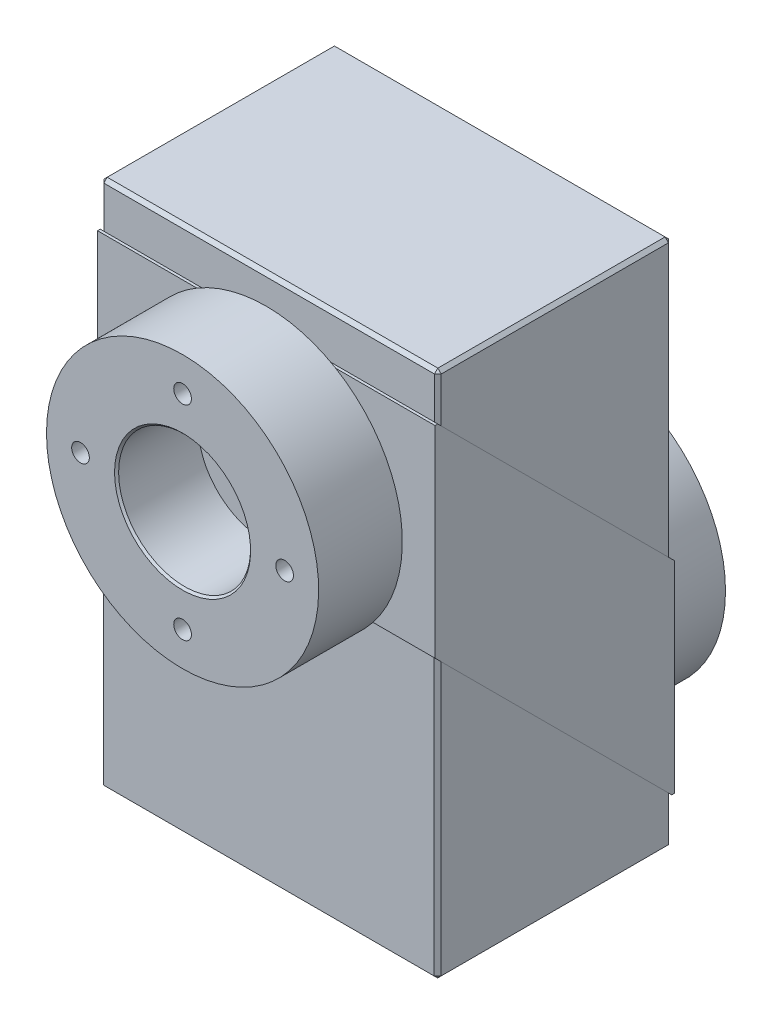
ISO-10303-21;
HEADER;
FILE_DESCRIPTION(('STEP AP214'),'2;1');
FILE_NAME('part.step','',(''),(''),'','','');
FILE_SCHEMA(('AUTOMOTIVE_DESIGN { 1 0 10303 214 1 1 1 1 }'));
ENDSEC;
DATA;
#1=APPLICATION_CONTEXT('core data for automotive mechanical design processes');
#2=APPLICATION_PROTOCOL_DEFINITION('international standard','automotive_design',2000,#1);
#3=PRODUCT_CONTEXT('',#1,'mechanical');
#4=PRODUCT('Part','Part','',(#3));
#5=PRODUCT_RELATED_PRODUCT_CATEGORY('part','',(#4));
#6=PRODUCT_DEFINITION_FORMATION('','',#4);
#7=PRODUCT_DEFINITION_CONTEXT('part definition',#1,'design');
#8=PRODUCT_DEFINITION('design','',#6,#7);
#9=PRODUCT_DEFINITION_SHAPE('','',#8);
#10=(LENGTH_UNIT() NAMED_UNIT(*) SI_UNIT(.MILLI.,.METRE.));
#11=(NAMED_UNIT(*) PLANE_ANGLE_UNIT() SI_UNIT($,.RADIAN.));
#12=(NAMED_UNIT(*) SI_UNIT($,.STERADIAN.) SOLID_ANGLE_UNIT());
#13=UNCERTAINTY_MEASURE_WITH_UNIT(LENGTH_MEASURE(1.E-05),#10,'distance_accuracy_value','');
#14=(GEOMETRIC_REPRESENTATION_CONTEXT(3) GLOBAL_UNCERTAINTY_ASSIGNED_CONTEXT((#13)) GLOBAL_UNIT_ASSIGNED_CONTEXT((#10,
#11,#12)) REPRESENTATION_CONTEXT('',''));
#15=CARTESIAN_POINT('',(0.,0.,0.));
#16=DIRECTION('',(0.,0.,1.));
#17=DIRECTION('',(1.,0.,0.));
#18=AXIS2_PLACEMENT_3D('',#15,#16,#17);
#19=CARTESIAN_POINT('',(0.,-45.9907683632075,-60.325));
#20=DIRECTION('',(0.,0.,-1.));
#21=DIRECTION('',(1.,0.,0.));
#22=AXIS2_PLACEMENT_3D('',#19,#20,#21);
#23=PLANE('',#22);
#24=CARTESIAN_POINT('',(0.,-45.9907683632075,-60.325));
#25=DIRECTION('',(0.,0.,-1.));
#26=DIRECTION('',(1.,0.,0.));
#27=AXIS2_PLACEMENT_3D('',#24,#25,#26);
#28=CIRCLE('',#27,12.7);
#29=CARTESIAN_POINT('',(12.7,-45.9907683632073,-60.325));
#30=VERTEX_POINT('',#29);
#31=EDGE_CURVE('E1682',#30,#30,#28,.F.);
#32=ORIENTED_EDGE('',*,*,#31,.T.);
#33=EDGE_LOOP('',(#32));
#34=FACE_BOUND('',#33,.T.);
#35=CARTESIAN_POINT('',(0.,-45.9907683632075,-60.325));
#36=DIRECTION('',(0.,0.,-1.));
#37=DIRECTION('',(1.,0.,0.));
#38=AXIS2_PLACEMENT_3D('',#35,#36,#37);
#39=CIRCLE('',#38,25.4);
#40=CARTESIAN_POINT('',(25.4,-45.9907683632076,-60.325));
#41=VERTEX_POINT('',#40);
#42=EDGE_CURVE('E308',#41,#41,#39,.T.);
#43=ORIENTED_EDGE('',*,*,#42,.T.);
#44=EDGE_LOOP('',(#43));
#45=FACE_BOUND('',#44,.T.);
#46=CARTESIAN_POINT('',(-1.35370662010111E-13,-65.0407683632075,-60.3250000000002));
#47=DIRECTION('',(0.,0.,-1.));
#48=DIRECTION('',(1.,0.,0.));
#49=AXIS2_PLACEMENT_3D('',#46,#47,#48);
#50=CIRCLE('',#49,1.64999999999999);
#51=CARTESIAN_POINT('',(1.64999999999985,-65.0407683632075,-60.3250000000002));
#52=VERTEX_POINT('',#51);
#53=EDGE_CURVE('E1670',#52,#52,#50,.T.);
#54=ORIENTED_EDGE('',*,*,#53,.F.);
#55=EDGE_LOOP('',(#54));
#56=FACE_BOUND('',#55,.T.);
#57=CARTESIAN_POINT('',(19.05,-45.9907683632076,-60.325));
#58=DIRECTION('',(0.,0.,-1.));
#59=DIRECTION('',(1.,0.,0.));
#60=AXIS2_PLACEMENT_3D('',#57,#58,#59);
#61=CIRCLE('',#60,1.64999999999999);
#62=CARTESIAN_POINT('',(20.7,-45.9907683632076,-60.325));
#63=VERTEX_POINT('',#62);
#64=EDGE_CURVE('E1660',#63,#63,#61,.T.);
#65=ORIENTED_EDGE('',*,*,#64,.F.);
#66=EDGE_LOOP('',(#65));
#67=FACE_BOUND('',#66,.T.);
#68=CARTESIAN_POINT('',(1.97698327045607E-13,-26.9407683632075,-60.3250000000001));
#69=DIRECTION('',(0.,0.,-1.));
#70=DIRECTION('',(1.,0.,0.));
#71=AXIS2_PLACEMENT_3D('',#68,#69,#70);
#72=CIRCLE('',#71,1.64999999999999);
#73=CARTESIAN_POINT('',(1.65000000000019,-26.9407683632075,-60.3250000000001));
#74=VERTEX_POINT('',#73);
#75=EDGE_CURVE('E1645',#74,#74,#72,.T.);
#76=ORIENTED_EDGE('',*,*,#75,.F.);
#77=EDGE_LOOP('',(#76));
#78=FACE_BOUND('',#77,.T.);
#79=CARTESIAN_POINT('',(-19.05,-45.9907683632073,-60.325));
#80=DIRECTION('',(0.,0.,-1.));
#81=DIRECTION('',(1.,0.,0.));
#82=AXIS2_PLACEMENT_3D('',#79,#80,#81);
#83=CIRCLE('',#82,1.64999999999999);
#84=CARTESIAN_POINT('',(-17.4,-45.9907683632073,-60.325));
#85=VERTEX_POINT('',#84);
#86=EDGE_CURVE('E1655',#85,#85,#83,.T.);
#87=ORIENTED_EDGE('',*,*,#86,.F.);
#88=EDGE_LOOP('',(#87));
#89=FACE_BOUND('',#88,.T.);
#90=ADVANCED_FACE('F15',(#34,#45,#56,#67,#78,#89),#23,.T.);
#91=CARTESIAN_POINT('',(-31.496,14.4673351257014,0.));
#92=DIRECTION('',(0.,0.,-1.));
#93=DIRECTION('',(0.,-1.,0.));
#94=AXIS2_PLACEMENT_3D('',#91,#92,#93);
#95=PLANE('',#94);
#96=CARTESIAN_POINT('',(0.,-7.89076836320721,0.));
#97=DIRECTION('',(0.,0.,1.));
#98=DIRECTION('',(-1.,0.,0.));
#99=AXIS2_PLACEMENT_3D('',#96,#97,#98);
#100=CIRCLE('',#99,25.4);
#101=CARTESIAN_POINT('',(-12.9511766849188,13.9593351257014,0.));
#102=VERTEX_POINT('',#101);
#103=CARTESIAN_POINT('',(-19.9240614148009,-23.644871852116,0.));
#104=VERTEX_POINT('',#103);
#105=EDGE_CURVE('E277',#102,#104,#100,.T.);
#106=ORIENTED_EDGE('',*,*,#105,.F.);
#107=DIRECTION('',(-1.,0.,0.));
#108=VECTOR('',#107,1.);
#109=CARTESIAN_POINT('',(-31.496,13.9593351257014,0.));
#110=LINE('',#109,#108);
#111=CARTESIAN_POINT('',(-31.496,13.9593351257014,0.));
#112=VERTEX_POINT('',#111);
#113=EDGE_CURVE('E25',#102,#112,#110,.T.);
#114=ORIENTED_EDGE('',*,*,#113,.T.);
#115=DIRECTION('',(0.,1.,0.));
#116=VECTOR('',#115,1.);
#117=CARTESIAN_POINT('',(-31.496,14.4673351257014,0.));
#118=LINE('',#117,#116);
#119=CARTESIAN_POINT('',(-31.496,-23.644871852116,0.));
#120=VERTEX_POINT('',#119);
#121=EDGE_CURVE('E590',#120,#112,#118,.T.);
#122=ORIENTED_EDGE('',*,*,#121,.F.);
#123=DIRECTION('',(1.,0.,0.));
#124=VECTOR('',#123,1.);
#125=CARTESIAN_POINT('',(-31.496,-23.644871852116,0.));
#126=LINE('',#125,#124);
#127=EDGE_CURVE('E279',#120,#104,#126,.T.);
#128=ORIENTED_EDGE('',*,*,#127,.T.);
#129=EDGE_LOOP('',(#106,#114,#122,#128));
#130=FACE_BOUND('',#129,.T.);
#131=ADVANCED_FACE('F278',(#130),#95,.F.);
#132=CARTESIAN_POINT('',(19.9240614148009,-23.644871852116,0.));
#133=VERTEX_POINT('',#132);
#134=CARTESIAN_POINT('',(12.9511766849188,13.9593351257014,0.));
#135=VERTEX_POINT('',#134);
#136=EDGE_CURVE('E31',#133,#135,#100,.T.);
#137=ORIENTED_EDGE('',*,*,#136,.F.);
#138=CARTESIAN_POINT('',(31.496,-23.644871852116,0.));
#139=VERTEX_POINT('',#138);
#140=EDGE_CURVE('E593',#133,#139,#126,.T.);
#141=ORIENTED_EDGE('',*,*,#140,.T.);
#142=DIRECTION('',(0.,1.,0.));
#143=VECTOR('',#142,1.);
#144=CARTESIAN_POINT('',(31.496,14.4673351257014,0.));
#145=LINE('',#144,#143);
#146=CARTESIAN_POINT('',(31.496,13.9593351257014,0.));
#147=VERTEX_POINT('',#146);
#148=EDGE_CURVE('E607',#139,#147,#145,.T.);
#149=ORIENTED_EDGE('',*,*,#148,.T.);
#150=EDGE_CURVE('E10',#147,#135,#110,.T.);
#151=ORIENTED_EDGE('',*,*,#150,.T.);
#152=EDGE_LOOP('',(#137,#141,#149,#151));
#153=FACE_BOUND('',#152,.T.);
#154=ADVANCED_FACE('F737',(#153),#95,.F.);
#155=CARTESIAN_POINT('',(-31.496,-68.3488718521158,-44.704));
#156=DIRECTION('',(0.,0.,1.));
#157=DIRECTION('',(0.,1.,0.));
#158=AXIS2_PLACEMENT_3D('',#155,#156,#157);
#159=PLANE('',#158);
#160=CARTESIAN_POINT('',(0.,-45.9907683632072,-44.704));
#161=DIRECTION('',(0.,0.,-1.));
#162=DIRECTION('',(1.,0.,0.));
#163=AXIS2_PLACEMENT_3D('',#160,#161,#162);
#164=CIRCLE('',#163,25.4);
#165=CARTESIAN_POINT('',(-12.9511766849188,-67.8408718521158,-44.704));
#166=VERTEX_POINT('',#165);
#167=CARTESIAN_POINT('',(-19.9240614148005,-30.2366648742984,-44.704));
#168=VERTEX_POINT('',#167);
#169=EDGE_CURVE('E317',#166,#168,#164,.T.);
#170=ORIENTED_EDGE('',*,*,#169,.F.);
#171=DIRECTION('',(-1.,0.,0.));
#172=VECTOR('',#171,1.);
#173=CARTESIAN_POINT('',(-31.496,-67.8408718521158,-44.704));
#174=LINE('',#173,#172);
#175=CARTESIAN_POINT('',(-31.496,-67.8408718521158,-44.704));
#176=VERTEX_POINT('',#175);
#177=EDGE_CURVE('E628',#166,#176,#174,.T.);
#178=ORIENTED_EDGE('',*,*,#177,.T.);
#179=DIRECTION('',(0.,-1.,0.));
#180=VECTOR('',#179,1.);
#181=CARTESIAN_POINT('',(-31.496,-68.3488718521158,-44.704));
#182=LINE('',#181,#180);
#183=CARTESIAN_POINT('',(-31.496,-30.2366648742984,-44.704));
#184=VERTEX_POINT('',#183);
#185=EDGE_CURVE('E580',#184,#176,#182,.T.);
#186=ORIENTED_EDGE('',*,*,#185,.F.);
#187=DIRECTION('',(1.,0.,0.));
#188=VECTOR('',#187,1.);
#189=CARTESIAN_POINT('',(-31.496,-30.2366648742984,-44.704));
#190=LINE('',#189,#188);
#191=EDGE_CURVE('E614',#184,#168,#190,.T.);
#192=ORIENTED_EDGE('',*,*,#191,.T.);
#193=EDGE_LOOP('',(#170,#178,#186,#192));
#194=FACE_BOUND('',#193,.T.);
#195=ADVANCED_FACE('F1546',(#194),#159,.F.);
#196=CARTESIAN_POINT('',(-31.496,-23.644871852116,0.));
#197=DIRECTION('',(0.,0.707106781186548,-0.707106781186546));
#198=DIRECTION('',(0.,-0.707106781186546,-0.707106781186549));
#199=AXIS2_PLACEMENT_3D('',#196,#197,#198);
#200=PLANE('',#199);
#201=DIRECTION('',(1.,0.,0.));
#202=VECTOR('',#201,1.);
#203=CARTESIAN_POINT('',(-31.496,-67.8219712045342,-44.1770993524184));
#204=LINE('',#203,#202);
#205=CARTESIAN_POINT('',(-30.861,-67.8219712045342,-44.1770993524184));
#206=VERTEX_POINT('',#205);
#207=CARTESIAN_POINT('',(30.861,-67.8219712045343,-44.1770993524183));
#208=VERTEX_POINT('',#207);
#209=EDGE_CURVE('E326',#206,#208,#204,.T.);
#210=ORIENTED_EDGE('',*,*,#209,.F.);
#211=DIRECTION('',(0.577350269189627,-0.577350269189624,-0.577350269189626));
#212=VECTOR('',#211,1.);
#213=CARTESIAN_POINT('',(-28.4818666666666,-70.2011045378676,-46.5562326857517));
#214=LINE('',#213,#212);
#215=CARTESIAN_POINT('',(-31.496,-67.1869712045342,-43.5420993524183));
#216=VERTEX_POINT('',#215);
#217=EDGE_CURVE('E347',#206,#216,#214,.F.);
#218=ORIENTED_EDGE('',*,*,#217,.T.);
#219=DIRECTION('',(0.,0.707106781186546,0.707106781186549));
#220=VECTOR('',#219,1.);
#221=CARTESIAN_POINT('',(-31.496,-23.644871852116,0.));
#222=LINE('',#221,#220);
#223=CARTESIAN_POINT('',(-31.496,-67.8408718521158,-44.196));
#224=VERTEX_POINT('',#223);
#225=EDGE_CURVE('E586',#224,#216,#222,.T.);
#226=ORIENTED_EDGE('',*,*,#225,.F.);
#227=DIRECTION('',(1.,0.,0.));
#228=VECTOR('',#227,1.);
#229=CARTESIAN_POINT('',(-31.496,-67.8408718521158,-44.196));
#230=LINE('',#229,#228);
#231=CARTESIAN_POINT('',(31.496,-67.8408718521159,-44.196));
#232=VERTEX_POINT('',#231);
#233=EDGE_CURVE('E618',#224,#232,#230,.T.);
#234=ORIENTED_EDGE('',*,*,#233,.T.);
#235=DIRECTION('',(0.,0.707106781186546,0.707106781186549));
#236=VECTOR('',#235,1.);
#237=CARTESIAN_POINT('',(31.496,-23.644871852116,0.));
#238=LINE('',#237,#236);
#239=CARTESIAN_POINT('',(31.496,-67.1869712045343,-43.5420993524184));
#240=VERTEX_POINT('',#239);
#241=EDGE_CURVE('E603',#232,#240,#238,.T.);
#242=ORIENTED_EDGE('',*,*,#241,.T.);
#243=DIRECTION('',(-0.577350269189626,-0.577350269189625,-0.577350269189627));
#244=VECTOR('',#243,1.);
#245=CARTESIAN_POINT('',(28.0585333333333,-70.6244378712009,-46.979566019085));
#246=LINE('',#245,#244);
#247=EDGE_CURVE('E350',#240,#208,#246,.T.);
#248=ORIENTED_EDGE('',*,*,#247,.T.);
#249=EDGE_LOOP('',(#210,#218,#226,#234,#242,#248));
#250=FACE_BOUND('',#249,.T.);
#251=ADVANCED_FACE('F1575',(#250),#200,.F.);
#252=CARTESIAN_POINT('',(-31.496,-24.7689712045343,-1.12409935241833));
#253=VERTEX_POINT('',#252);
#254=EDGE_CURVE('E585',#253,#120,#222,.T.);
#255=ORIENTED_EDGE('',*,*,#254,.F.);
#256=DIRECTION('',(-0.577350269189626,-0.577350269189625,-0.577350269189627));
#257=VECTOR('',#256,1.);
#258=CARTESIAN_POINT('',(-48.6494666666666,-41.9224378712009,-18.277566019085));
#259=LINE('',#258,#257);
#260=CARTESIAN_POINT('',(-30.861,-24.1339712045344,-0.489099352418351));
#261=VERTEX_POINT('',#260);
#262=EDGE_CURVE('E353',#253,#261,#259,.F.);
#263=ORIENTED_EDGE('',*,*,#262,.T.);
#264=DIRECTION('',(1.,0.,0.));
#265=VECTOR('',#264,1.);
#266=CARTESIAN_POINT('',(-31.496,-24.1339712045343,-0.489099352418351));
#267=LINE('',#266,#265);
#268=CARTESIAN_POINT('',(30.861,-24.1339712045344,-0.489099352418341));
#269=VERTEX_POINT('',#268);
#270=EDGE_CURVE('E334',#261,#269,#267,.T.);
#271=ORIENTED_EDGE('',*,*,#270,.T.);
#272=DIRECTION('',(0.577350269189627,-0.577350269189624,-0.577350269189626));
#273=VECTOR('',#272,1.);
#274=CARTESIAN_POINT('',(48.2261333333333,-41.4991045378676,-17.8542326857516));
#275=LINE('',#274,#273);
#276=CARTESIAN_POINT('',(31.496,-24.7689712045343,-1.12409935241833));
#277=VERTEX_POINT('',#276);
#278=EDGE_CURVE('E356',#269,#277,#275,.T.);
#279=ORIENTED_EDGE('',*,*,#278,.T.);
#280=EDGE_CURVE('E602',#277,#139,#238,.T.);
#281=ORIENTED_EDGE('',*,*,#280,.T.);
#282=ORIENTED_EDGE('',*,*,#140,.F.);
#283=DIRECTION('',(1.,0.,0.));
#284=VECTOR('',#283,1.);
#285=CARTESIAN_POINT('',(-31.496,-23.644871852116,0.));
#286=LINE('',#285,#284);
#287=EDGE_CURVE('E38',#104,#133,#286,.T.);
#288=ORIENTED_EDGE('',*,*,#287,.F.);
#289=ORIENTED_EDGE('',*,*,#127,.F.);
#290=EDGE_LOOP('',(#255,#263,#271,#279,#281,#282,#288,#289));
#291=FACE_BOUND('',#290,.T.);
#292=ADVANCED_FACE('F1565',(#291),#200,.F.);
#293=CARTESIAN_POINT('',(-31.496,14.4673351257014,0.));
#294=DIRECTION('',(0.,-0.707106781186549,0.707106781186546));
#295=DIRECTION('',(0.,0.707106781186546,0.707106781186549));
#296=AXIS2_PLACEMENT_3D('',#293,#294,#295);
#297=PLANE('',#296);
#298=DIRECTION('',(1.,0.,0.));
#299=VECTOR('',#298,1.);
#300=CARTESIAN_POINT('',(-31.496,13.934330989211,-0.533004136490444));
#301=LINE('',#300,#299);
#302=CARTESIAN_POINT('',(-30.861,13.934330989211,-0.533004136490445));
#303=VERTEX_POINT('',#302);
#304=CARTESIAN_POINT('',(30.861,13.9343309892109,-0.533004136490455));
#305=VERTEX_POINT('',#304);
#306=EDGE_CURVE('E453',#303,#305,#301,.T.);
#307=ORIENTED_EDGE('',*,*,#306,.F.);
#308=DIRECTION('',(0.577350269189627,0.577350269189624,0.577350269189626));
#309=VECTOR('',#308,1.);
#310=CARTESIAN_POINT('',(-28.4818666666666,16.3134643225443,1.84612919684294));
#311=LINE('',#310,#309);
#312=CARTESIAN_POINT('',(-31.496,13.299330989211,-1.16800413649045));
#313=VERTEX_POINT('',#312);
#314=EDGE_CURVE('E474',#303,#313,#311,.F.);
#315=ORIENTED_EDGE('',*,*,#314,.T.);
#316=DIRECTION('',(0.,-0.707106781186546,-0.707106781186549));
#317=VECTOR('',#316,1.);
#318=CARTESIAN_POINT('',(-31.496,14.4673351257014,0.));
#319=LINE('',#318,#317);
#320=CARTESIAN_POINT('',(-31.496,13.9593351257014,-0.508000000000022));
#321=VERTEX_POINT('',#320);
#322=EDGE_CURVE('E576',#321,#313,#319,.T.);
#323=ORIENTED_EDGE('',*,*,#322,.F.);
#324=DIRECTION('',(1.,0.,0.));
#325=VECTOR('',#324,1.);
#326=CARTESIAN_POINT('',(-31.496,13.9593351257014,-0.508000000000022));
#327=LINE('',#326,#325);
#328=CARTESIAN_POINT('',(31.496,13.9593351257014,-0.508000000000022));
#329=VERTEX_POINT('',#328);
#330=EDGE_CURVE('E275',#321,#329,#327,.T.);
#331=ORIENTED_EDGE('',*,*,#330,.T.);
#332=DIRECTION('',(0.,-0.707106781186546,-0.707106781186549));
#333=VECTOR('',#332,1.);
#334=CARTESIAN_POINT('',(31.496,14.4673351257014,0.));
#335=LINE('',#334,#333);
#336=CARTESIAN_POINT('',(31.496,13.299330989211,-1.16800413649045));
#337=VERTEX_POINT('',#336);
#338=EDGE_CURVE('E594',#329,#337,#335,.T.);
#339=ORIENTED_EDGE('',*,*,#338,.T.);
#340=DIRECTION('',(-0.577350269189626,0.577350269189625,0.577350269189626));
#341=VECTOR('',#340,1.);
#342=CARTESIAN_POINT('',(28.0585333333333,16.7367976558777,2.26946253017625));
#343=LINE('',#342,#341);
#344=EDGE_CURVE('E477',#337,#305,#343,.T.);
#345=ORIENTED_EDGE('',*,*,#344,.T.);
#346=EDGE_LOOP('',(#307,#315,#323,#331,#339,#345));
#347=FACE_BOUND('',#346,.T.);
#348=ADVANCED_FACE('F644',(#347),#297,.F.);
#349=CARTESIAN_POINT('',(-31.496,-29.1186690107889,-43.5860041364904));
#350=VERTEX_POINT('',#349);
#351=EDGE_CURVE('E581',#350,#184,#319,.T.);
#352=ORIENTED_EDGE('',*,*,#351,.F.);
#353=DIRECTION('',(-0.577350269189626,0.577350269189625,0.577350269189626));
#354=VECTOR('',#353,1.);
#355=CARTESIAN_POINT('',(-48.6494666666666,-11.9652023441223,-26.4325374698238));
#356=LINE('',#355,#354);
#357=CARTESIAN_POINT('',(-30.861,-29.7536690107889,-44.2210041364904));
#358=VERTEX_POINT('',#357);
#359=EDGE_CURVE('E480',#350,#358,#356,.F.);
#360=ORIENTED_EDGE('',*,*,#359,.T.);
#361=DIRECTION('',(1.,0.,0.));
#362=VECTOR('',#361,1.);
#363=CARTESIAN_POINT('',(-31.496,-29.7536690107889,-44.2210041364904));
#364=LINE('',#363,#362);
#365=CARTESIAN_POINT('',(30.861,-29.7536690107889,-44.2210041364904));
#366=VERTEX_POINT('',#365);
#367=EDGE_CURVE('E461',#358,#366,#364,.T.);
#368=ORIENTED_EDGE('',*,*,#367,.T.);
#369=DIRECTION('',(0.577350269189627,0.577350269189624,0.577350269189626));
#370=VECTOR('',#369,1.);
#371=CARTESIAN_POINT('',(48.2261333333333,-12.3885356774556,-26.8558708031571));
#372=LINE('',#371,#370);
#373=CARTESIAN_POINT('',(31.496,-29.1186690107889,-43.5860041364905));
#374=VERTEX_POINT('',#373);
#375=EDGE_CURVE('E483',#366,#374,#372,.T.);
#376=ORIENTED_EDGE('',*,*,#375,.T.);
#377=CARTESIAN_POINT('',(31.496,-30.2366648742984,-44.704));
#378=VERTEX_POINT('',#377);
#379=EDGE_CURVE('E530',#374,#378,#335,.T.);
#380=ORIENTED_EDGE('',*,*,#379,.T.);
#381=CARTESIAN_POINT('',(19.9240614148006,-30.2366648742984,-44.704));
#382=VERTEX_POINT('',#381);
#383=EDGE_CURVE('E613',#382,#378,#190,.T.);
#384=ORIENTED_EDGE('',*,*,#383,.F.);
#385=DIRECTION('',(1.,0.,0.));
#386=VECTOR('',#385,1.);
#387=CARTESIAN_POINT('',(-31.496,-30.2366648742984,-44.704));
#388=LINE('',#387,#386);
#389=EDGE_CURVE('E312',#168,#382,#388,.T.);
#390=ORIENTED_EDGE('',*,*,#389,.F.);
#391=ORIENTED_EDGE('',*,*,#191,.F.);
#392=EDGE_LOOP('',(#352,#360,#368,#376,#380,#384,#390,#391));
#393=FACE_BOUND('',#392,.T.);
#394=ADVANCED_FACE('F710',(#393),#297,.F.);
#395=CARTESIAN_POINT('',(12.9511766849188,-67.8408718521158,-44.704));
#396=VERTEX_POINT('',#395);
#397=EDGE_CURVE('E307',#382,#396,#164,.T.);
#398=ORIENTED_EDGE('',*,*,#397,.F.);
#399=ORIENTED_EDGE('',*,*,#383,.T.);
#400=DIRECTION('',(0.,-1.,0.));
#401=VECTOR('',#400,1.);
#402=CARTESIAN_POINT('',(31.496,-68.3488718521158,-44.704));
#403=LINE('',#402,#401);
#404=CARTESIAN_POINT('',(31.496,-67.8408718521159,-44.704));
#405=VERTEX_POINT('',#404);
#406=EDGE_CURVE('E598',#378,#405,#403,.T.);
#407=ORIENTED_EDGE('',*,*,#406,.T.);
#408=EDGE_CURVE('E629',#405,#396,#174,.T.);
#409=ORIENTED_EDGE('',*,*,#408,.T.);
#410=EDGE_LOOP('',(#398,#399,#407,#409));
#411=FACE_BOUND('',#410,.T.);
#412=ADVANCED_FACE('F1533',(#411),#159,.F.);
#413=CARTESIAN_POINT('',(-31.496,-30.2366648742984,-44.704));
#414=DIRECTION('',(1.,0.,0.));
#415=DIRECTION('',(0.,0.707106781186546,0.707106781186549));
#416=AXIS2_PLACEMENT_3D('',#413,#414,#415);
#417=PLANE('',#416);
#418=ORIENTED_EDGE('',*,*,#185,.T.);
#419=DIRECTION('',(0.,0.,-1.));
#420=VECTOR('',#419,1.);
#421=CARTESIAN_POINT('',(-31.496,-67.8408718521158,-44.196));
#422=LINE('',#421,#420);
#423=EDGE_CURVE('E636',#176,#224,#422,.F.);
#424=ORIENTED_EDGE('',*,*,#423,.T.);
#425=ORIENTED_EDGE('',*,*,#225,.T.);
#426=DIRECTION('',(0.,-0.707106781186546,-0.707106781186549));
#427=VECTOR('',#426,1.);
#428=CARTESIAN_POINT('',(-31.496,-67.8219712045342,-44.1770993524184));
#429=LINE('',#428,#427);
#430=EDGE_CURVE('E322',#253,#216,#429,.T.);
#431=ORIENTED_EDGE('',*,*,#430,.F.);
#432=ORIENTED_EDGE('',*,*,#254,.T.);
#433=ORIENTED_EDGE('',*,*,#121,.T.);
#434=DIRECTION('',(0.,0.,1.));
#435=VECTOR('',#434,1.);
#436=CARTESIAN_POINT('',(-31.496,13.9593351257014,-0.508000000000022));
#437=LINE('',#436,#435);
#438=EDGE_CURVE('E270',#112,#321,#437,.F.);
#439=ORIENTED_EDGE('',*,*,#438,.T.);
#440=ORIENTED_EDGE('',*,*,#322,.T.);
#441=DIRECTION('',(0.,0.707106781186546,0.707106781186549));
#442=VECTOR('',#441,1.);
#443=CARTESIAN_POINT('',(-31.496,13.934330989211,-0.533004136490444));
#444=LINE('',#443,#442);
#445=EDGE_CURVE('E449',#350,#313,#444,.T.);
#446=ORIENTED_EDGE('',*,*,#445,.F.);
#447=ORIENTED_EDGE('',*,*,#351,.T.);
#448=EDGE_LOOP('',(#418,#424,#425,#431,#432,#433,#439,#440,#446,#447));
#449=FACE_BOUND('',#448,.T.);
#450=ADVANCED_FACE('F1523',(#449),#417,.F.);
#451=CARTESIAN_POINT('',(31.496,-30.2366648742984,-44.704));
#452=DIRECTION('',(1.,0.,0.));
#453=DIRECTION('',(0.,0.707106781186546,0.707106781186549));
#454=AXIS2_PLACEMENT_3D('',#451,#452,#453);
#455=PLANE('',#454);
#456=ORIENTED_EDGE('',*,*,#241,.F.);
#457=DIRECTION('',(0.,0.,1.));
#458=VECTOR('',#457,1.);
#459=CARTESIAN_POINT('',(31.496,-67.8408718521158,-44.7040000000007));
#460=LINE('',#459,#458);
#461=EDGE_CURVE('E625',#232,#405,#460,.F.);
#462=ORIENTED_EDGE('',*,*,#461,.T.);
#463=ORIENTED_EDGE('',*,*,#406,.F.);
#464=ORIENTED_EDGE('',*,*,#379,.F.);
#465=DIRECTION('',(0.,0.707106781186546,0.707106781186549));
#466=VECTOR('',#465,1.);
#467=CARTESIAN_POINT('',(31.496,13.934330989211,-0.533004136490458));
#468=LINE('',#467,#466);
#469=EDGE_CURVE('E454',#374,#337,#468,.T.);
#470=ORIENTED_EDGE('',*,*,#469,.T.);
#471=ORIENTED_EDGE('',*,*,#338,.F.);
#472=DIRECTION('',(0.,0.,-1.));
#473=VECTOR('',#472,1.);
#474=CARTESIAN_POINT('',(31.496,13.9593351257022,-44.7039999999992));
#475=LINE('',#474,#473);
#476=EDGE_CURVE('E622',#329,#147,#475,.F.);
#477=ORIENTED_EDGE('',*,*,#476,.T.);
#478=ORIENTED_EDGE('',*,*,#148,.F.);
#479=ORIENTED_EDGE('',*,*,#280,.F.);
#480=DIRECTION('',(0.,-0.707106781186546,-0.707106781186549));
#481=VECTOR('',#480,1.);
#482=CARTESIAN_POINT('',(31.496,-67.8219712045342,-44.1770993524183));
#483=LINE('',#482,#481);
#484=EDGE_CURVE('E327',#277,#240,#483,.T.);
#485=ORIENTED_EDGE('',*,*,#484,.T.);
#486=EDGE_LOOP('',(#456,#462,#463,#464,#470,#471,#477,#478,#479,#485));
#487=FACE_BOUND('',#486,.T.);
#488=ADVANCED_FACE('F647',(#487),#455,.T.);
#489=CARTESIAN_POINT('',(-31.496,-67.8408718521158,-44.196));
#490=DIRECTION('',(0.,1.,0.));
#491=DIRECTION('',(1.,0.,0.));
#492=AXIS2_PLACEMENT_3D('',#489,#490,#491);
#493=PLANE('',#492);
#494=ORIENTED_EDGE('',*,*,#423,.F.);
#495=ORIENTED_EDGE('',*,*,#177,.F.);
#496=EDGE_CURVE('E633',#396,#166,#174,.T.);
#497=ORIENTED_EDGE('',*,*,#496,.F.);
#498=ORIENTED_EDGE('',*,*,#408,.F.);
#499=ORIENTED_EDGE('',*,*,#461,.F.);
#500=ORIENTED_EDGE('',*,*,#233,.F.);
#501=EDGE_LOOP('',(#494,#495,#497,#498,#499,#500));
#502=FACE_BOUND('',#501,.T.);
#503=ADVANCED_FACE('F729',(#502),#493,.F.);
#504=CARTESIAN_POINT('',(-31.496,13.9593351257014,-0.508000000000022));
#505=DIRECTION('',(0.,-1.,0.));
#506=DIRECTION('',(1.,0.,0.));
#507=AXIS2_PLACEMENT_3D('',#504,#505,#506);
#508=PLANE('',#507);
#509=ORIENTED_EDGE('',*,*,#438,.F.);
#510=ORIENTED_EDGE('',*,*,#113,.F.);
#511=EDGE_CURVE('E24',#135,#102,#110,.T.);
#512=ORIENTED_EDGE('',*,*,#511,.F.);
#513=ORIENTED_EDGE('',*,*,#150,.F.);
#514=ORIENTED_EDGE('',*,*,#476,.F.);
#515=ORIENTED_EDGE('',*,*,#330,.F.);
#516=EDGE_LOOP('',(#509,#510,#512,#513,#514,#515));
#517=FACE_BOUND('',#516,.T.);
#518=ADVANCED_FACE('F17',(#517),#508,.F.);
#519=CARTESIAN_POINT('',(-31.496,22.3417309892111,-44.2210041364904));
#520=DIRECTION('',(0.,-1.,0.));
#521=DIRECTION('',(1.,0.,0.));
#522=AXIS2_PLACEMENT_3D('',#519,#520,#521);
#523=PLANE('',#522);
#524=DIRECTION('',(0.,0.,-1.));
#525=VECTOR('',#524,1.);
#526=CARTESIAN_POINT('',(30.861,22.3417309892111,-44.2210041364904));
#527=LINE('',#526,#525);
#528=CARTESIAN_POINT('',(30.861,22.3417309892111,-1.16800413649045));
#529=VERTEX_POINT('',#528);
#530=CARTESIAN_POINT('',(30.861,22.3417309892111,-43.5860041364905));
#531=VERTEX_POINT('',#530);
#532=EDGE_CURVE('E520',#529,#531,#527,.T.);
#533=ORIENTED_EDGE('',*,*,#532,.T.);
#534=DIRECTION('',(-1.,0.,0.));
#535=VECTOR('',#534,1.);
#536=CARTESIAN_POINT('',(-31.496,22.3417309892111,-43.5860041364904));
#537=LINE('',#536,#535);
#538=CARTESIAN_POINT('',(-30.861,22.3417309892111,-43.5860041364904));
#539=VERTEX_POINT('',#538);
#540=EDGE_CURVE('E526',#531,#539,#537,.T.);
#541=ORIENTED_EDGE('',*,*,#540,.T.);
#542=DIRECTION('',(0.,0.,1.));
#543=VECTOR('',#542,1.);
#544=CARTESIAN_POINT('',(-30.861,22.3417309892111,-44.2210041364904));
#545=LINE('',#544,#543);
#546=CARTESIAN_POINT('',(-30.861,22.3417309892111,-1.16800413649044));
#547=VERTEX_POINT('',#546);
#548=EDGE_CURVE('E523',#539,#547,#545,.T.);
#549=ORIENTED_EDGE('',*,*,#548,.T.);
#550=DIRECTION('',(1.,0.,0.));
#551=VECTOR('',#550,1.);
#552=CARTESIAN_POINT('',(-31.496,22.3417309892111,-1.16800413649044));
#553=LINE('',#552,#551);
#554=EDGE_CURVE('E517',#547,#529,#553,.T.);
#555=ORIENTED_EDGE('',*,*,#554,.T.);
#556=EDGE_LOOP('',(#533,#541,#549,#555));
#557=FACE_BOUND('',#556,.T.);
#558=ADVANCED_FACE('F720',(#557),#523,.F.);
#559=CARTESIAN_POINT('',(-31.496,22.3417309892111,-44.2210041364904));
#560=DIRECTION('',(0.,0.,1.));
#561=DIRECTION('',(-1.,0.,0.));
#562=AXIS2_PLACEMENT_3D('',#559,#560,#561);
#563=PLANE('',#562);
#564=DIRECTION('',(1.,0.,0.));
#565=VECTOR('',#564,1.);
#566=CARTESIAN_POINT('',(-31.496,21.7067309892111,-44.2210041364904));
#567=LINE('',#566,#565);
#568=CARTESIAN_POINT('',(-30.861,21.7067309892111,-44.2210041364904));
#569=VERTEX_POINT('',#568);
#570=CARTESIAN_POINT('',(30.861,21.7067309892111,-44.2210041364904));
#571=VERTEX_POINT('',#570);
#572=EDGE_CURVE('E464',#569,#571,#567,.T.);
#573=ORIENTED_EDGE('',*,*,#572,.T.);
#574=DIRECTION('',(0.,-1.,0.));
#575=VECTOR('',#574,1.);
#576=CARTESIAN_POINT('',(30.861,-29.7536690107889,-44.2210041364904));
#577=LINE('',#576,#575);
#578=EDGE_CURVE('E470',#571,#366,#577,.T.);
#579=ORIENTED_EDGE('',*,*,#578,.T.);
#580=ORIENTED_EDGE('',*,*,#367,.F.);
#581=DIRECTION('',(0.,1.,0.));
#582=VECTOR('',#581,1.);
#583=CARTESIAN_POINT('',(-30.861,22.3417309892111,-44.2210041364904));
#584=LINE('',#583,#582);
#585=EDGE_CURVE('E467',#358,#569,#584,.T.);
#586=ORIENTED_EDGE('',*,*,#585,.T.);
#587=EDGE_LOOP('',(#573,#579,#580,#586));
#588=FACE_BOUND('',#587,.T.);
#589=ADVANCED_FACE('F714',(#588),#563,.F.);
#590=CARTESIAN_POINT('',(-31.496,22.3417309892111,-0.533004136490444));
#591=DIRECTION('',(0.,0.,-1.));
#592=DIRECTION('',(1.,0.,0.));
#593=AXIS2_PLACEMENT_3D('',#590,#591,#592);
#594=PLANE('',#593);
#595=ORIENTED_EDGE('',*,*,#306,.T.);
#596=DIRECTION('',(0.,1.,0.));
#597=VECTOR('',#596,1.);
#598=CARTESIAN_POINT('',(30.861,22.3417309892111,-0.533004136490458));
#599=LINE('',#598,#597);
#600=CARTESIAN_POINT('',(30.861,21.7067309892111,-0.533004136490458));
#601=VERTEX_POINT('',#600);
#602=EDGE_CURVE('E514',#305,#601,#599,.T.);
#603=ORIENTED_EDGE('',*,*,#602,.T.);
#604=DIRECTION('',(-1.,0.,0.));
#605=VECTOR('',#604,1.);
#606=CARTESIAN_POINT('',(-31.496,21.7067309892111,-0.533004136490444));
#607=LINE('',#606,#605);
#608=CARTESIAN_POINT('',(-30.861,21.7067309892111,-0.533004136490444));
#609=VERTEX_POINT('',#608);
#610=EDGE_CURVE('E507',#601,#609,#607,.T.);
#611=ORIENTED_EDGE('',*,*,#610,.T.);
#612=DIRECTION('',(0.,-1.,0.));
#613=VECTOR('',#612,1.);
#614=CARTESIAN_POINT('',(-30.861,22.3417309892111,-0.533004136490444));
#615=LINE('',#614,#613);
#616=EDGE_CURVE('E510',#609,#303,#615,.T.);
#617=ORIENTED_EDGE('',*,*,#616,.T.);
#618=EDGE_LOOP('',(#595,#603,#611,#617));
#619=FACE_BOUND('',#618,.T.);
#620=ADVANCED_FACE('F685',(#619),#594,.F.);
#621=CARTESIAN_POINT('',(-31.496,22.3417309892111,-0.533004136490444));
#622=DIRECTION('',(1.,0.,0.));
#623=DIRECTION('',(0.,1.,0.));
#624=AXIS2_PLACEMENT_3D('',#621,#622,#623);
#625=PLANE('',#624);
#626=DIRECTION('',(0.,0.,-1.));
#627=VECTOR('',#626,1.);
#628=CARTESIAN_POINT('',(-31.496,21.7067309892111,-0.533004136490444));
#629=LINE('',#628,#627);
#630=CARTESIAN_POINT('',(-31.496,21.7067309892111,-1.16800413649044));
#631=VERTEX_POINT('',#630);
#632=CARTESIAN_POINT('',(-31.496,21.7067309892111,-43.5860041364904));
#633=VERTEX_POINT('',#632);
#634=EDGE_CURVE('E497',#631,#633,#629,.T.);
#635=ORIENTED_EDGE('',*,*,#634,.T.);
#636=DIRECTION('',(0.,-1.,0.));
#637=VECTOR('',#636,1.);
#638=CARTESIAN_POINT('',(-31.496,22.3417309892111,-43.5860041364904));
#639=LINE('',#638,#637);
#640=EDGE_CURVE('E503',#633,#350,#639,.T.);
#641=ORIENTED_EDGE('',*,*,#640,.T.);
#642=ORIENTED_EDGE('',*,*,#445,.T.);
#643=DIRECTION('',(0.,1.,0.));
#644=VECTOR('',#643,1.);
#645=CARTESIAN_POINT('',(-31.496,22.3417309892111,-1.16800413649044));
#646=LINE('',#645,#644);
#647=EDGE_CURVE('E500',#313,#631,#646,.T.);
#648=ORIENTED_EDGE('',*,*,#647,.T.);
#649=EDGE_LOOP('',(#635,#641,#642,#648));
#650=FACE_BOUND('',#649,.T.);
#651=ADVANCED_FACE('F701',(#650),#625,.F.);
#652=CARTESIAN_POINT('',(31.496,22.3417309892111,-0.533004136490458));
#653=DIRECTION('',(1.,0.,0.));
#654=DIRECTION('',(0.,1.,0.));
#655=AXIS2_PLACEMENT_3D('',#652,#653,#654);
#656=PLANE('',#655);
#657=ORIENTED_EDGE('',*,*,#469,.F.);
#658=DIRECTION('',(0.,1.,0.));
#659=VECTOR('',#658,1.);
#660=CARTESIAN_POINT('',(31.496,22.3417309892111,-43.5860041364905));
#661=LINE('',#660,#659);
#662=CARTESIAN_POINT('',(31.496,21.7067309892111,-43.5860041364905));
#663=VERTEX_POINT('',#662);
#664=EDGE_CURVE('E494',#374,#663,#661,.T.);
#665=ORIENTED_EDGE('',*,*,#664,.T.);
#666=DIRECTION('',(0.,0.,1.));
#667=VECTOR('',#666,1.);
#668=CARTESIAN_POINT('',(31.496,21.7067309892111,-0.533004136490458));
#669=LINE('',#668,#667);
#670=CARTESIAN_POINT('',(31.496,21.7067309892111,-1.16800413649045));
#671=VERTEX_POINT('',#670);
#672=EDGE_CURVE('E487',#663,#671,#669,.T.);
#673=ORIENTED_EDGE('',*,*,#672,.T.);
#674=DIRECTION('',(0.,-1.,0.));
#675=VECTOR('',#674,1.);
#676=CARTESIAN_POINT('',(31.496,13.934330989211,-1.16800413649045));
#677=LINE('',#676,#675);
#678=EDGE_CURVE('E490',#671,#337,#677,.T.);
#679=ORIENTED_EDGE('',*,*,#678,.T.);
#680=EDGE_LOOP('',(#657,#665,#673,#679));
#681=FACE_BOUND('',#680,.T.);
#682=ADVANCED_FACE('F654',(#681),#656,.T.);
#683=CARTESIAN_POINT('',(-31.496,22.3417309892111,-1.16800413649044));
#684=DIRECTION('',(0.707106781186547,0.,-0.707106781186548));
#685=DIRECTION('',(0.707106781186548,0.,0.707106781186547));
#686=AXIS2_PLACEMENT_3D('',#683,#684,#685);
#687=PLANE('',#686);
#688=DIRECTION('',(-0.707106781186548,0.,-0.707106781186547));
#689=VECTOR('',#688,1.);
#690=CARTESIAN_POINT('',(-31.496,21.7067309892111,-1.16800413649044));
#691=LINE('',#690,#689);
#692=EDGE_CURVE('E457',#631,#609,#691,.F.);
#693=ORIENTED_EDGE('',*,*,#692,.F.);
#694=ORIENTED_EDGE('',*,*,#647,.F.);
#695=ORIENTED_EDGE('',*,*,#314,.F.);
#696=ORIENTED_EDGE('',*,*,#616,.F.);
#697=EDGE_LOOP('',(#693,#694,#695,#696));
#698=FACE_BOUND('',#697,.T.);
#699=ADVANCED_FACE('F689',(#698),#687,.F.);
#700=CARTESIAN_POINT('',(-31.496,21.7067309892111,-1.16800413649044));
#701=DIRECTION('',(-0.577350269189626,0.577350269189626,0.577350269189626));
#702=DIRECTION('',(-0.707106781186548,-0.707106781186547,0.));
#703=AXIS2_PLACEMENT_3D('',#700,#701,#702);
#704=PLANE('',#703);
#705=DIRECTION('',(0.707106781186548,0.707106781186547,0.));
#706=VECTOR('',#705,1.);
#707=CARTESIAN_POINT('',(-31.496,21.7067309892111,-1.16800413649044));
#708=LINE('',#707,#706);
#709=EDGE_CURVE('E565',#631,#547,#708,.T.);
#710=ORIENTED_EDGE('',*,*,#709,.F.);
#711=ORIENTED_EDGE('',*,*,#692,.T.);
#712=DIRECTION('',(0.,-0.707106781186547,0.707106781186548));
#713=VECTOR('',#712,1.);
#714=CARTESIAN_POINT('',(-30.861,22.0242309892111,-0.850504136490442));
#715=LINE('',#714,#713);
#716=EDGE_CURVE('E569',#547,#609,#715,.T.);
#717=ORIENTED_EDGE('',*,*,#716,.F.);
#718=EDGE_LOOP('',(#710,#711,#717));
#719=FACE_BOUND('',#718,.T.);
#720=ADVANCED_FACE('F693',(#719),#704,.T.);
#721=CARTESIAN_POINT('',(30.861,22.3417309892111,-0.533004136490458));
#722=DIRECTION('',(0.707106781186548,0.,0.707106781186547));
#723=DIRECTION('',(-0.707106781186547,0.,0.707106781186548));
#724=AXIS2_PLACEMENT_3D('',#721,#722,#723);
#725=PLANE('',#724);
#726=ORIENTED_EDGE('',*,*,#344,.F.);
#727=ORIENTED_EDGE('',*,*,#678,.F.);
#728=DIRECTION('',(0.707106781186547,0.,-0.707106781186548));
#729=VECTOR('',#728,1.);
#730=CARTESIAN_POINT('',(30.861,21.7067309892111,-0.533004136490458));
#731=LINE('',#730,#729);
#732=EDGE_CURVE('E561',#601,#671,#731,.T.);
#733=ORIENTED_EDGE('',*,*,#732,.F.);
#734=ORIENTED_EDGE('',*,*,#602,.F.);
#735=EDGE_LOOP('',(#726,#727,#733,#734));
#736=FACE_BOUND('',#735,.T.);
#737=ADVANCED_FACE('F673',(#736),#725,.T.);
#738=CARTESIAN_POINT('',(-31.496,22.3417309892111,-1.16800413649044));
#739=DIRECTION('',(0.,-0.707106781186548,-0.707106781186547));
#740=DIRECTION('',(0.,-0.707106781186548,0.707106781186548));
#741=AXIS2_PLACEMENT_3D('',#738,#739,#740);
#742=PLANE('',#741);
#743=ORIENTED_EDGE('',*,*,#716,.T.);
#744=ORIENTED_EDGE('',*,*,#610,.F.);
#745=DIRECTION('',(0.,0.707106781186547,-0.707106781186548));
#746=VECTOR('',#745,1.);
#747=CARTESIAN_POINT('',(30.861,21.7067309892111,-0.533004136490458));
#748=LINE('',#747,#746);
#749=EDGE_CURVE('E557',#529,#601,#748,.F.);
#750=ORIENTED_EDGE('',*,*,#749,.F.);
#751=ORIENTED_EDGE('',*,*,#554,.F.);
#752=EDGE_LOOP('',(#743,#744,#750,#751));
#753=FACE_BOUND('',#752,.T.);
#754=ADVANCED_FACE('F681',(#753),#742,.F.);
#755=CARTESIAN_POINT('',(-31.496,21.7067309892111,-0.533004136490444));
#756=DIRECTION('',(0.707106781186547,-0.707106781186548,0.));
#757=DIRECTION('',(0.707106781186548,0.707106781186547,0.));
#758=AXIS2_PLACEMENT_3D('',#755,#756,#757);
#759=PLANE('',#758);
#760=ORIENTED_EDGE('',*,*,#709,.T.);
#761=ORIENTED_EDGE('',*,*,#548,.F.);
#762=DIRECTION('',(-0.707106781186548,-0.707106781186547,0.));
#763=VECTOR('',#762,1.);
#764=CARTESIAN_POINT('',(-31.1785,22.0242309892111,-43.5860041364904));
#765=LINE('',#764,#763);
#766=EDGE_CURVE('E553',#633,#539,#765,.F.);
#767=ORIENTED_EDGE('',*,*,#766,.F.);
#768=ORIENTED_EDGE('',*,*,#634,.F.);
#769=EDGE_LOOP('',(#760,#761,#767,#768));
#770=FACE_BOUND('',#769,.T.);
#771=ADVANCED_FACE('F698',(#770),#759,.F.);
#772=CARTESIAN_POINT('',(-31.496,22.3417309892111,-43.5860041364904));
#773=DIRECTION('',(0.707106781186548,0.,0.707106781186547));
#774=DIRECTION('',(-0.707106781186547,0.,0.707106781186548));
#775=AXIS2_PLACEMENT_3D('',#772,#773,#774);
#776=PLANE('',#775);
#777=ORIENTED_EDGE('',*,*,#359,.F.);
#778=ORIENTED_EDGE('',*,*,#640,.F.);
#779=DIRECTION('',(0.707106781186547,0.,-0.707106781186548));
#780=VECTOR('',#779,1.);
#781=CARTESIAN_POINT('',(-30.861,21.7067309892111,-44.2210041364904));
#782=LINE('',#781,#780);
#783=EDGE_CURVE('E549',#569,#633,#782,.F.);
#784=ORIENTED_EDGE('',*,*,#783,.F.);
#785=ORIENTED_EDGE('',*,*,#585,.F.);
#786=EDGE_LOOP('',(#777,#778,#784,#785));
#787=FACE_BOUND('',#786,.T.);
#788=ADVANCED_FACE('F705',(#787),#776,.F.);
#789=CARTESIAN_POINT('',(30.861,21.7067309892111,-0.533004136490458));
#790=DIRECTION('',(0.577350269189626,0.577350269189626,0.577350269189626));
#791=DIRECTION('',(-0.707106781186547,0.707106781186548,0.));
#792=AXIS2_PLACEMENT_3D('',#789,#790,#791);
#793=PLANE('',#792);
#794=ORIENTED_EDGE('',*,*,#749,.T.);
#795=ORIENTED_EDGE('',*,*,#732,.T.);
#796=DIRECTION('',(-0.707106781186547,0.707106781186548,0.));
#797=VECTOR('',#796,1.);
#798=CARTESIAN_POINT('',(31.1785,22.0242309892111,-1.16800413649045));
#799=LINE('',#798,#797);
#800=EDGE_CURVE('E545',#529,#671,#799,.F.);
#801=ORIENTED_EDGE('',*,*,#800,.F.);
#802=EDGE_LOOP('',(#794,#795,#801));
#803=FACE_BOUND('',#802,.T.);
#804=ADVANCED_FACE('F676',(#803),#793,.T.);
#805=CARTESIAN_POINT('',(-30.861,21.7067309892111,-44.2210041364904));
#806=DIRECTION('',(-0.577350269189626,0.577350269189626,-0.577350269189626));
#807=DIRECTION('',(-0.707106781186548,-0.707106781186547,0.));
#808=AXIS2_PLACEMENT_3D('',#805,#806,#807);
#809=PLANE('',#808);
#810=ORIENTED_EDGE('',*,*,#783,.T.);
#811=ORIENTED_EDGE('',*,*,#766,.T.);
#812=DIRECTION('',(0.,0.707106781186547,0.707106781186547));
#813=VECTOR('',#812,1.);
#814=CARTESIAN_POINT('',(-30.861,21.7067309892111,-44.2210041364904));
#815=LINE('',#814,#813);
#816=EDGE_CURVE('E542',#569,#539,#815,.T.);
#817=ORIENTED_EDGE('',*,*,#816,.F.);
#818=EDGE_LOOP('',(#810,#811,#817));
#819=FACE_BOUND('',#818,.T.);
#820=ADVANCED_FACE('F882',(#819),#809,.T.);
#821=CARTESIAN_POINT('',(30.861,22.3417309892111,-44.2210041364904));
#822=DIRECTION('',(0.707106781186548,0.707106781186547,0.));
#823=DIRECTION('',(-0.707106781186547,0.707106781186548,0.));
#824=AXIS2_PLACEMENT_3D('',#821,#822,#823);
#825=PLANE('',#824);
#826=ORIENTED_EDGE('',*,*,#800,.T.);
#827=ORIENTED_EDGE('',*,*,#672,.F.);
#828=DIRECTION('',(0.707106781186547,-0.707106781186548,0.));
#829=VECTOR('',#828,1.);
#830=CARTESIAN_POINT('',(31.496,21.7067309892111,-43.5860041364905));
#831=LINE('',#830,#829);
#832=EDGE_CURVE('E538',#531,#663,#831,.T.);
#833=ORIENTED_EDGE('',*,*,#832,.F.);
#834=ORIENTED_EDGE('',*,*,#532,.F.);
#835=EDGE_LOOP('',(#826,#827,#833,#834));
#836=FACE_BOUND('',#835,.T.);
#837=ADVANCED_FACE('F669',(#836),#825,.T.);
#838=CARTESIAN_POINT('',(-31.496,21.7067309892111,-44.2210041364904));
#839=DIRECTION('',(0.,-0.707106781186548,0.707106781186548));
#840=DIRECTION('',(0.,0.707106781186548,0.707106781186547));
#841=AXIS2_PLACEMENT_3D('',#838,#839,#840);
#842=PLANE('',#841);
#843=ORIENTED_EDGE('',*,*,#816,.T.);
#844=ORIENTED_EDGE('',*,*,#540,.F.);
#845=DIRECTION('',(0.,-0.707106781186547,-0.707106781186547));
#846=VECTOR('',#845,1.);
#847=CARTESIAN_POINT('',(30.861,22.0242309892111,-43.9035041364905));
#848=LINE('',#847,#846);
#849=EDGE_CURVE('E534',#571,#531,#848,.F.);
#850=ORIENTED_EDGE('',*,*,#849,.F.);
#851=ORIENTED_EDGE('',*,*,#572,.F.);
#852=EDGE_LOOP('',(#843,#844,#850,#851));
#853=FACE_BOUND('',#852,.T.);
#854=ADVANCED_FACE('F718',(#853),#842,.F.);
#855=CARTESIAN_POINT('',(31.496,21.7067309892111,-43.5860041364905));
#856=DIRECTION('',(0.577350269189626,0.577350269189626,-0.577350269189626));
#857=DIRECTION('',(-0.707106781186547,0.707106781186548,0.));
#858=AXIS2_PLACEMENT_3D('',#855,#856,#857);
#859=PLANE('',#858);
#860=ORIENTED_EDGE('',*,*,#849,.T.);
#861=ORIENTED_EDGE('',*,*,#832,.T.);
#862=DIRECTION('',(-0.707106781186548,0.,-0.707106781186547));
#863=VECTOR('',#862,1.);
#864=CARTESIAN_POINT('',(31.496,21.7067309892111,-43.5860041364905));
#865=LINE('',#864,#863);
#866=EDGE_CURVE('E403',#571,#663,#865,.F.);
#867=ORIENTED_EDGE('',*,*,#866,.F.);
#868=EDGE_LOOP('',(#860,#861,#867));
#869=FACE_BOUND('',#868,.T.);
#870=ADVANCED_FACE('F664',(#869),#859,.T.);
#871=CARTESIAN_POINT('',(30.861,22.3417309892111,-44.2210041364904));
#872=DIRECTION('',(0.707106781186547,0.,-0.707106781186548));
#873=DIRECTION('',(0.707106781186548,0.,0.707106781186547));
#874=AXIS2_PLACEMENT_3D('',#871,#872,#873);
#875=PLANE('',#874);
#876=ORIENTED_EDGE('',*,*,#866,.T.);
#877=ORIENTED_EDGE('',*,*,#664,.F.);
#878=ORIENTED_EDGE('',*,*,#375,.F.);
#879=ORIENTED_EDGE('',*,*,#578,.F.);
#880=EDGE_LOOP('',(#876,#877,#878,#879));
#881=FACE_BOUND('',#880,.T.);
#882=ADVANCED_FACE('F660',(#881),#875,.T.);
#883=CARTESIAN_POINT('',(-31.496,-76.2293712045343,-0.489099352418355));
#884=DIRECTION('',(0.,1.,0.));
#885=DIRECTION('',(1.,0.,0.));
#886=AXIS2_PLACEMENT_3D('',#883,#884,#885);
#887=PLANE('',#886);
#888=DIRECTION('',(0.,0.,1.));
#889=VECTOR('',#888,1.);
#890=CARTESIAN_POINT('',(30.861,-76.2293712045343,-0.489099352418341));
#891=LINE('',#890,#889);
#892=CARTESIAN_POINT('',(30.861,-76.2293712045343,-43.5420993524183));
#893=VERTEX_POINT('',#892);
#894=CARTESIAN_POINT('',(30.861,-76.2293712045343,-1.12409935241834));
#895=VERTEX_POINT('',#894);
#896=EDGE_CURVE('E393',#893,#895,#891,.T.);
#897=ORIENTED_EDGE('',*,*,#896,.T.);
#898=DIRECTION('',(-1.,0.,0.));
#899=VECTOR('',#898,1.);
#900=CARTESIAN_POINT('',(-31.496,-76.2293712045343,-1.12409935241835));
#901=LINE('',#900,#899);
#902=CARTESIAN_POINT('',(-30.861,-76.2293712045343,-1.12409935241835));
#903=VERTEX_POINT('',#902);
#904=EDGE_CURVE('E399',#895,#903,#901,.T.);
#905=ORIENTED_EDGE('',*,*,#904,.T.);
#906=DIRECTION('',(0.,0.,-1.));
#907=VECTOR('',#906,1.);
#908=CARTESIAN_POINT('',(-30.861,-76.2293712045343,-0.489099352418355));
#909=LINE('',#908,#907);
#910=CARTESIAN_POINT('',(-30.861,-76.2293712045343,-43.5420993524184));
#911=VERTEX_POINT('',#910);
#912=EDGE_CURVE('E396',#903,#911,#909,.T.);
#913=ORIENTED_EDGE('',*,*,#912,.T.);
#914=DIRECTION('',(1.,0.,0.));
#915=VECTOR('',#914,1.);
#916=CARTESIAN_POINT('',(-31.496,-76.2293712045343,-43.5420993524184));
#917=LINE('',#916,#915);
#918=EDGE_CURVE('E390',#911,#893,#917,.T.);
#919=ORIENTED_EDGE('',*,*,#918,.T.);
#920=EDGE_LOOP('',(#897,#905,#913,#919));
#921=FACE_BOUND('',#920,.T.);
#922=ADVANCED_FACE('F770',(#921),#887,.F.);
#923=CARTESIAN_POINT('',(-31.496,-76.2293712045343,-0.489099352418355));
#924=DIRECTION('',(0.,0.,-1.));
#925=DIRECTION('',(-1.,0.,0.));
#926=AXIS2_PLACEMENT_3D('',#923,#924,#925);
#927=PLANE('',#926);
#928=DIRECTION('',(1.,0.,0.));
#929=VECTOR('',#928,1.);
#930=CARTESIAN_POINT('',(-31.496,-75.5943712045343,-0.489099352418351));
#931=LINE('',#930,#929);
#932=CARTESIAN_POINT('',(-30.861,-75.5943712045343,-0.489099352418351));
#933=VERTEX_POINT('',#932);
#934=CARTESIAN_POINT('',(30.861,-75.5943712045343,-0.489099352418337));
#935=VERTEX_POINT('',#934);
#936=EDGE_CURVE('E337',#933,#935,#931,.T.);
#937=ORIENTED_EDGE('',*,*,#936,.T.);
#938=DIRECTION('',(0.,1.,0.));
#939=VECTOR('',#938,1.);
#940=CARTESIAN_POINT('',(30.861,-24.1339712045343,-0.489099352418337));
#941=LINE('',#940,#939);
#942=EDGE_CURVE('E343',#935,#269,#941,.T.);
#943=ORIENTED_EDGE('',*,*,#942,.T.);
#944=ORIENTED_EDGE('',*,*,#270,.F.);
#945=DIRECTION('',(0.,-1.,0.));
#946=VECTOR('',#945,1.);
#947=CARTESIAN_POINT('',(-30.861,-76.2293712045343,-0.489099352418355));
#948=LINE('',#947,#946);
#949=EDGE_CURVE('E340',#261,#933,#948,.T.);
#950=ORIENTED_EDGE('',*,*,#949,.T.);
#951=EDGE_LOOP('',(#937,#943,#944,#950));
#952=FACE_BOUND('',#951,.T.);
#953=ADVANCED_FACE('F766',(#952),#927,.F.);
#954=CARTESIAN_POINT('',(-31.496,-76.2293712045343,-44.1770993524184));
#955=DIRECTION('',(0.,0.,1.));
#956=DIRECTION('',(1.,0.,0.));
#957=AXIS2_PLACEMENT_3D('',#954,#955,#956);
#958=PLANE('',#957);
#959=ORIENTED_EDGE('',*,*,#209,.T.);
#960=DIRECTION('',(0.,-1.,0.));
#961=VECTOR('',#960,1.);
#962=CARTESIAN_POINT('',(30.861,-76.2293712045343,-44.1770993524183));
#963=LINE('',#962,#961);
#964=CARTESIAN_POINT('',(30.861,-75.5943712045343,-44.1770993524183));
#965=VERTEX_POINT('',#964);
#966=EDGE_CURVE('E387',#208,#965,#963,.T.);
#967=ORIENTED_EDGE('',*,*,#966,.T.);
#968=DIRECTION('',(-1.,0.,0.));
#969=VECTOR('',#968,1.);
#970=CARTESIAN_POINT('',(-31.496,-75.5943712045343,-44.1770993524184));
#971=LINE('',#970,#969);
#972=CARTESIAN_POINT('',(-30.861,-75.5943712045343,-44.1770993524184));
#973=VERTEX_POINT('',#972);
#974=EDGE_CURVE('E380',#965,#973,#971,.T.);
#975=ORIENTED_EDGE('',*,*,#974,.T.);
#976=DIRECTION('',(0.,1.,0.));
#977=VECTOR('',#976,1.);
#978=CARTESIAN_POINT('',(-30.861,-76.2293712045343,-44.1770993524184));
#979=LINE('',#978,#977);
#980=EDGE_CURVE('E383',#973,#206,#979,.T.);
#981=ORIENTED_EDGE('',*,*,#980,.T.);
#982=EDGE_LOOP('',(#959,#967,#975,#981));
#983=FACE_BOUND('',#982,.T.);
#984=ADVANCED_FACE('F758',(#983),#958,.F.);
#985=CARTESIAN_POINT('',(-31.496,-76.2293712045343,-44.1770993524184));
#986=DIRECTION('',(1.,0.,0.));
#987=DIRECTION('',(0.,-1.,0.));
#988=AXIS2_PLACEMENT_3D('',#985,#986,#987);
#989=PLANE('',#988);
#990=DIRECTION('',(0.,0.,1.));
#991=VECTOR('',#990,1.);
#992=CARTESIAN_POINT('',(-31.496,-75.5943712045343,-44.1770993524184));
#993=LINE('',#992,#991);
#994=CARTESIAN_POINT('',(-31.496,-75.5943712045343,-43.5420993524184));
#995=VERTEX_POINT('',#994);
#996=CARTESIAN_POINT('',(-31.496,-75.5943712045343,-1.12409935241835));
#997=VERTEX_POINT('',#996);
#998=EDGE_CURVE('E370',#995,#997,#993,.T.);
#999=ORIENTED_EDGE('',*,*,#998,.T.);
#1000=DIRECTION('',(0.,1.,0.));
#1001=VECTOR('',#1000,1.);
#1002=CARTESIAN_POINT('',(-31.496,-76.2293712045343,-1.12409935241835));
#1003=LINE('',#1002,#1001);
#1004=EDGE_CURVE('E376',#997,#253,#1003,.T.);
#1005=ORIENTED_EDGE('',*,*,#1004,.T.);
#1006=ORIENTED_EDGE('',*,*,#430,.T.);
#1007=DIRECTION('',(0.,-1.,0.));
#1008=VECTOR('',#1007,1.);
#1009=CARTESIAN_POINT('',(-31.496,-76.2293712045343,-43.5420993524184));
#1010=LINE('',#1009,#1008);
#1011=EDGE_CURVE('E373',#216,#995,#1010,.T.);
#1012=ORIENTED_EDGE('',*,*,#1011,.T.);
#1013=EDGE_LOOP('',(#999,#1005,#1006,#1012));
#1014=FACE_BOUND('',#1013,.T.);
#1015=ADVANCED_FACE('F754',(#1014),#989,.F.);
#1016=CARTESIAN_POINT('',(31.496,-76.2293712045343,-44.1770993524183));
#1017=DIRECTION('',(1.,0.,0.));
#1018=DIRECTION('',(0.,-1.,0.));
#1019=AXIS2_PLACEMENT_3D('',#1016,#1017,#1018);
#1020=PLANE('',#1019);
#1021=ORIENTED_EDGE('',*,*,#484,.F.);
#1022=DIRECTION('',(0.,-1.,0.));
#1023=VECTOR('',#1022,1.);
#1024=CARTESIAN_POINT('',(31.496,-76.2293712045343,-1.12409935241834));
#1025=LINE('',#1024,#1023);
#1026=CARTESIAN_POINT('',(31.496,-75.5943712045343,-1.12409935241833));
#1027=VERTEX_POINT('',#1026);
#1028=EDGE_CURVE('E367',#277,#1027,#1025,.T.);
#1029=ORIENTED_EDGE('',*,*,#1028,.T.);
#1030=DIRECTION('',(0.,0.,-1.));
#1031=VECTOR('',#1030,1.);
#1032=CARTESIAN_POINT('',(31.496,-75.5943712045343,-44.1770993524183));
#1033=LINE('',#1032,#1031);
#1034=CARTESIAN_POINT('',(31.496,-75.5943712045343,-43.5420993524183));
#1035=VERTEX_POINT('',#1034);
#1036=EDGE_CURVE('E360',#1027,#1035,#1033,.T.);
#1037=ORIENTED_EDGE('',*,*,#1036,.T.);
#1038=DIRECTION('',(0.,1.,0.));
#1039=VECTOR('',#1038,1.);
#1040=CARTESIAN_POINT('',(31.496,-67.8219712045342,-43.5420993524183));
#1041=LINE('',#1040,#1039);
#1042=EDGE_CURVE('E363',#1035,#240,#1041,.T.);
#1043=ORIENTED_EDGE('',*,*,#1042,.T.);
#1044=EDGE_LOOP('',(#1021,#1029,#1037,#1043));
#1045=FACE_BOUND('',#1044,.T.);
#1046=ADVANCED_FACE('F757',(#1045),#1020,.T.);
#1047=CARTESIAN_POINT('',(-31.496,-76.2293712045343,-43.5420993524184));
#1048=DIRECTION('',(0.707106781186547,0.,0.707106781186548));
#1049=DIRECTION('',(0.707106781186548,0.,-0.707106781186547));
#1050=AXIS2_PLACEMENT_3D('',#1047,#1048,#1049);
#1051=PLANE('',#1050);
#1052=DIRECTION('',(-0.707106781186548,0.,0.707106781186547));
#1053=VECTOR('',#1052,1.);
#1054=CARTESIAN_POINT('',(-31.496,-75.5943712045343,-43.5420993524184));
#1055=LINE('',#1054,#1053);
#1056=EDGE_CURVE('E330',#995,#973,#1055,.F.);
#1057=ORIENTED_EDGE('',*,*,#1056,.F.);
#1058=ORIENTED_EDGE('',*,*,#1011,.F.);
#1059=ORIENTED_EDGE('',*,*,#217,.F.);
#1060=ORIENTED_EDGE('',*,*,#980,.F.);
#1061=EDGE_LOOP('',(#1057,#1058,#1059,#1060));
#1062=FACE_BOUND('',#1061,.T.);
#1063=ADVANCED_FACE('F762',(#1062),#1051,.F.);
#1064=CARTESIAN_POINT('',(-31.496,-75.5943712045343,-43.5420993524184));
#1065=DIRECTION('',(-0.577350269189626,-0.577350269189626,-0.577350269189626));
#1066=DIRECTION('',(-0.707106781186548,0.707106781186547,0.));
#1067=AXIS2_PLACEMENT_3D('',#1064,#1065,#1066);
#1068=PLANE('',#1067);
#1069=DIRECTION('',(0.707106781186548,-0.707106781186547,0.));
#1070=VECTOR('',#1069,1.);
#1071=CARTESIAN_POINT('',(-31.496,-75.5943712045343,-43.5420993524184));
#1072=LINE('',#1071,#1070);
#1073=EDGE_CURVE('E438',#995,#911,#1072,.T.);
#1074=ORIENTED_EDGE('',*,*,#1073,.F.);
#1075=ORIENTED_EDGE('',*,*,#1056,.T.);
#1076=DIRECTION('',(0.,0.707106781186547,-0.707106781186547));
#1077=VECTOR('',#1076,1.);
#1078=CARTESIAN_POINT('',(-30.861,-75.9118712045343,-43.8595993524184));
#1079=LINE('',#1078,#1077);
#1080=EDGE_CURVE('E442',#911,#973,#1079,.T.);
#1081=ORIENTED_EDGE('',*,*,#1080,.F.);
#1082=EDGE_LOOP('',(#1074,#1075,#1081));
#1083=FACE_BOUND('',#1082,.T.);
#1084=ADVANCED_FACE('F813',(#1083),#1068,.T.);
#1085=CARTESIAN_POINT('',(30.861,-76.2293712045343,-44.1770993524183));
#1086=DIRECTION('',(0.707106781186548,0.,-0.707106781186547));
#1087=DIRECTION('',(-0.707106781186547,0.,-0.707106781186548));
#1088=AXIS2_PLACEMENT_3D('',#1085,#1086,#1087);
#1089=PLANE('',#1088);
#1090=ORIENTED_EDGE('',*,*,#247,.F.);
#1091=ORIENTED_EDGE('',*,*,#1042,.F.);
#1092=DIRECTION('',(0.707106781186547,0.,0.707106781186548));
#1093=VECTOR('',#1092,1.);
#1094=CARTESIAN_POINT('',(30.861,-75.5943712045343,-44.1770993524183));
#1095=LINE('',#1094,#1093);
#1096=EDGE_CURVE('E434',#965,#1035,#1095,.T.);
#1097=ORIENTED_EDGE('',*,*,#1096,.F.);
#1098=ORIENTED_EDGE('',*,*,#966,.F.);
#1099=EDGE_LOOP('',(#1090,#1091,#1097,#1098));
#1100=FACE_BOUND('',#1099,.T.);
#1101=ADVANCED_FACE('F809',(#1100),#1089,.T.);
#1102=CARTESIAN_POINT('',(-31.496,-76.2293712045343,-43.5420993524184));
#1103=DIRECTION('',(0.,0.707106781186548,0.707106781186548));
#1104=DIRECTION('',(0.,0.707106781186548,-0.707106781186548));
#1105=AXIS2_PLACEMENT_3D('',#1102,#1103,#1104);
#1106=PLANE('',#1105);
#1107=ORIENTED_EDGE('',*,*,#1080,.T.);
#1108=ORIENTED_EDGE('',*,*,#974,.F.);
#1109=DIRECTION('',(0.,-0.707106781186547,0.707106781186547));
#1110=VECTOR('',#1109,1.);
#1111=CARTESIAN_POINT('',(30.861,-75.5943712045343,-44.1770993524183));
#1112=LINE('',#1111,#1110);
#1113=EDGE_CURVE('E430',#893,#965,#1112,.F.);
#1114=ORIENTED_EDGE('',*,*,#1113,.F.);
#1115=ORIENTED_EDGE('',*,*,#918,.F.);
#1116=EDGE_LOOP('',(#1107,#1108,#1114,#1115));
#1117=FACE_BOUND('',#1116,.T.);
#1118=ADVANCED_FACE('F805',(#1117),#1106,.F.);
#1119=CARTESIAN_POINT('',(-31.496,-75.5943712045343,-44.1770993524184));
#1120=DIRECTION('',(0.707106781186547,0.707106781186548,0.));
#1121=DIRECTION('',(0.707106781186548,-0.707106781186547,0.));
#1122=AXIS2_PLACEMENT_3D('',#1119,#1120,#1121);
#1123=PLANE('',#1122);
#1124=ORIENTED_EDGE('',*,*,#1073,.T.);
#1125=ORIENTED_EDGE('',*,*,#912,.F.);
#1126=DIRECTION('',(-0.707106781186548,0.707106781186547,0.));
#1127=VECTOR('',#1126,1.);
#1128=CARTESIAN_POINT('',(-31.1785,-75.9118712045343,-1.12409935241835));
#1129=LINE('',#1128,#1127);
#1130=EDGE_CURVE('E426',#997,#903,#1129,.F.);
#1131=ORIENTED_EDGE('',*,*,#1130,.F.);
#1132=ORIENTED_EDGE('',*,*,#998,.F.);
#1133=EDGE_LOOP('',(#1124,#1125,#1131,#1132));
#1134=FACE_BOUND('',#1133,.T.);
#1135=ADVANCED_FACE('F801',(#1134),#1123,.F.);
#1136=CARTESIAN_POINT('',(-31.496,-76.2293712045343,-1.12409935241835));
#1137=DIRECTION('',(0.707106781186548,0.,-0.707106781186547));
#1138=DIRECTION('',(-0.707106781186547,0.,-0.707106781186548));
#1139=AXIS2_PLACEMENT_3D('',#1136,#1137,#1138);
#1140=PLANE('',#1139);
#1141=ORIENTED_EDGE('',*,*,#262,.F.);
#1142=ORIENTED_EDGE('',*,*,#1004,.F.);
#1143=DIRECTION('',(0.707106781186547,0.,0.707106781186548));
#1144=VECTOR('',#1143,1.);
#1145=CARTESIAN_POINT('',(-30.861,-75.5943712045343,-0.489099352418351));
#1146=LINE('',#1145,#1144);
#1147=EDGE_CURVE('E422',#933,#997,#1146,.F.);
#1148=ORIENTED_EDGE('',*,*,#1147,.F.);
#1149=ORIENTED_EDGE('',*,*,#949,.F.);
#1150=EDGE_LOOP('',(#1141,#1142,#1148,#1149));
#1151=FACE_BOUND('',#1150,.T.);
#1152=ADVANCED_FACE('F797',(#1151),#1140,.F.);
#1153=CARTESIAN_POINT('',(30.861,-75.5943712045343,-44.1770993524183));
#1154=DIRECTION('',(0.577350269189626,-0.577350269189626,-0.577350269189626));
#1155=DIRECTION('',(-0.707106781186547,-0.707106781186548,0.));
#1156=AXIS2_PLACEMENT_3D('',#1153,#1154,#1155);
#1157=PLANE('',#1156);
#1158=ORIENTED_EDGE('',*,*,#1113,.T.);
#1159=ORIENTED_EDGE('',*,*,#1096,.T.);
#1160=DIRECTION('',(-0.707106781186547,-0.707106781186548,0.));
#1161=VECTOR('',#1160,1.);
#1162=CARTESIAN_POINT('',(31.1785,-75.9118712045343,-43.5420993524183));
#1163=LINE('',#1162,#1161);
#1164=EDGE_CURVE('E418',#893,#1035,#1163,.F.);
#1165=ORIENTED_EDGE('',*,*,#1164,.F.);
#1166=EDGE_LOOP('',(#1158,#1159,#1165));
#1167=FACE_BOUND('',#1166,.T.);
#1168=ADVANCED_FACE('F793',(#1167),#1157,.T.);
#1169=CARTESIAN_POINT('',(-30.861,-75.5943712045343,-0.489099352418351));
#1170=DIRECTION('',(-0.577350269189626,-0.577350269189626,0.577350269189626));
#1171=DIRECTION('',(-0.707106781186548,0.707106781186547,0.));
#1172=AXIS2_PLACEMENT_3D('',#1169,#1170,#1171);
#1173=PLANE('',#1172);
#1174=ORIENTED_EDGE('',*,*,#1147,.T.);
#1175=ORIENTED_EDGE('',*,*,#1130,.T.);
#1176=DIRECTION('',(0.,-0.707106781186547,-0.707106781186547));
#1177=VECTOR('',#1176,1.);
#1178=CARTESIAN_POINT('',(-30.861,-75.5943712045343,-0.489099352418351));
#1179=LINE('',#1178,#1177);
#1180=EDGE_CURVE('E415',#933,#903,#1179,.T.);
#1181=ORIENTED_EDGE('',*,*,#1180,.F.);
#1182=EDGE_LOOP('',(#1174,#1175,#1181));
#1183=FACE_BOUND('',#1182,.T.);
#1184=ADVANCED_FACE('F789',(#1183),#1173,.T.);
#1185=CARTESIAN_POINT('',(30.861,-76.2293712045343,-0.489099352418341));
#1186=DIRECTION('',(0.707106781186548,-0.707106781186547,0.));
#1187=DIRECTION('',(-0.707106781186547,-0.707106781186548,0.));
#1188=AXIS2_PLACEMENT_3D('',#1185,#1186,#1187);
#1189=PLANE('',#1188);
#1190=ORIENTED_EDGE('',*,*,#1164,.T.);
#1191=ORIENTED_EDGE('',*,*,#1036,.F.);
#1192=DIRECTION('',(0.707106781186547,0.707106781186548,0.));
#1193=VECTOR('',#1192,1.);
#1194=CARTESIAN_POINT('',(31.496,-75.5943712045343,-1.12409935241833));
#1195=LINE('',#1194,#1193);
#1196=EDGE_CURVE('E411',#895,#1027,#1195,.T.);
#1197=ORIENTED_EDGE('',*,*,#1196,.F.);
#1198=ORIENTED_EDGE('',*,*,#896,.F.);
#1199=EDGE_LOOP('',(#1190,#1191,#1197,#1198));
#1200=FACE_BOUND('',#1199,.T.);
#1201=ADVANCED_FACE('F785',(#1200),#1189,.T.);
#1202=CARTESIAN_POINT('',(-31.496,-75.5943712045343,-0.489099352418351));
#1203=DIRECTION('',(0.,0.707106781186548,-0.707106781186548));
#1204=DIRECTION('',(0.,-0.707106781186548,-0.707106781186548));
#1205=AXIS2_PLACEMENT_3D('',#1202,#1203,#1204);
#1206=PLANE('',#1205);
#1207=ORIENTED_EDGE('',*,*,#1180,.T.);
#1208=ORIENTED_EDGE('',*,*,#904,.F.);
#1209=DIRECTION('',(0.,0.707106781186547,0.707106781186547));
#1210=VECTOR('',#1209,1.);
#1211=CARTESIAN_POINT('',(30.861,-75.9118712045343,-0.806599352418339));
#1212=LINE('',#1211,#1210);
#1213=EDGE_CURVE('E407',#935,#895,#1212,.F.);
#1214=ORIENTED_EDGE('',*,*,#1213,.F.);
#1215=ORIENTED_EDGE('',*,*,#936,.F.);
#1216=EDGE_LOOP('',(#1207,#1208,#1214,#1215));
#1217=FACE_BOUND('',#1216,.T.);
#1218=ADVANCED_FACE('F781',(#1217),#1206,.F.);
#1219=CARTESIAN_POINT('',(31.496,-75.5943712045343,-1.12409935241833));
#1220=DIRECTION('',(0.577350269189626,-0.577350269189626,0.577350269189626));
#1221=DIRECTION('',(-0.707106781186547,-0.707106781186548,0.));
#1222=AXIS2_PLACEMENT_3D('',#1219,#1220,#1221);
#1223=PLANE('',#1222);
#1224=ORIENTED_EDGE('',*,*,#1213,.T.);
#1225=ORIENTED_EDGE('',*,*,#1196,.T.);
#1226=DIRECTION('',(-0.707106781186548,0.,0.707106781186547));
#1227=VECTOR('',#1226,1.);
#1228=CARTESIAN_POINT('',(31.496,-75.5943712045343,-1.12409935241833));
#1229=LINE('',#1228,#1227);
#1230=EDGE_CURVE('E321',#935,#1027,#1229,.F.);
#1231=ORIENTED_EDGE('',*,*,#1230,.F.);
#1232=EDGE_LOOP('',(#1224,#1225,#1231));
#1233=FACE_BOUND('',#1232,.T.);
#1234=ADVANCED_FACE('F777',(#1233),#1223,.T.);
#1235=CARTESIAN_POINT('',(30.861,-76.2293712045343,-0.489099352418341));
#1236=DIRECTION('',(0.707106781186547,0.,0.707106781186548));
#1237=DIRECTION('',(0.707106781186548,0.,-0.707106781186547));
#1238=AXIS2_PLACEMENT_3D('',#1235,#1236,#1237);
#1239=PLANE('',#1238);
#1240=ORIENTED_EDGE('',*,*,#1230,.T.);
#1241=ORIENTED_EDGE('',*,*,#1028,.F.);
#1242=ORIENTED_EDGE('',*,*,#278,.F.);
#1243=ORIENTED_EDGE('',*,*,#942,.F.);
#1244=EDGE_LOOP('',(#1240,#1241,#1242,#1243));
#1245=FACE_BOUND('',#1244,.T.);
#1246=ADVANCED_FACE('F748',(#1245),#1239,.T.);
#1247=CARTESIAN_POINT('',(0.,-45.9907683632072,-44.704));
#1248=DIRECTION('',(0.,0.,-1.));
#1249=DIRECTION('',(1.,0.,0.));
#1250=AXIS2_PLACEMENT_3D('',#1247,#1248,#1249);
#1251=PLANE('',#1250);
#1252=ORIENTED_EDGE('',*,*,#496,.T.);
#1253=EDGE_CURVE('E313',#396,#166,#164,.T.);
#1254=ORIENTED_EDGE('',*,*,#1253,.F.);
#1255=EDGE_LOOP('',(#1252,#1254));
#1256=FACE_BOUND('',#1255,.T.);
#1257=ADVANCED_FACE('F744',(#1256),#1251,.F.);
#1258=CARTESIAN_POINT('',(0.,-45.9907683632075,-60.325));
#1259=DIRECTION('',(0.,0.,1.));
#1260=DIRECTION('',(-1.,0.,0.));
#1261=AXIS2_PLACEMENT_3D('',#1258,#1259,#1260);
#1262=CYLINDRICAL_SURFACE('',#1261,25.4);
#1263=ORIENTED_EDGE('',*,*,#42,.F.);
#1264=EDGE_LOOP('',(#1263));
#1265=FACE_BOUND('',#1264,.T.);
#1266=ORIENTED_EDGE('',*,*,#1253,.T.);
#1267=ORIENTED_EDGE('',*,*,#169,.T.);
#1268=EDGE_CURVE('E1785',#168,#382,#164,.T.);
#1269=ORIENTED_EDGE('',*,*,#1268,.T.);
#1270=ORIENTED_EDGE('',*,*,#397,.T.);
#1271=EDGE_LOOP('',(#1266,#1267,#1269,#1270));
#1272=FACE_BOUND('',#1271,.T.);
#1273=ADVANCED_FACE('F747',(#1265,#1272),#1262,.T.);
#1274=ORIENTED_EDGE('',*,*,#1268,.F.);
#1275=ORIENTED_EDGE('',*,*,#389,.T.);
#1276=EDGE_LOOP('',(#1274,#1275));
#1277=FACE_BOUND('',#1276,.T.);
#1278=ADVANCED_FACE('F750',(#1277),#1251,.F.);
#1279=CARTESIAN_POINT('',(0.,-7.89076836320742,15.621));
#1280=DIRECTION('',(0.,0.,1.));
#1281=DIRECTION('',(-1.,0.,0.));
#1282=AXIS2_PLACEMENT_3D('',#1279,#1280,#1281);
#1283=PLANE('',#1282);
#1284=CARTESIAN_POINT('',(19.05,-7.89076836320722,15.621));
#1285=DIRECTION('',(0.,0.,1.));
#1286=DIRECTION('',(-1.,0.,0.));
#1287=AXIS2_PLACEMENT_3D('',#1284,#1285,#1286);
#1288=CIRCLE('',#1287,1.64999999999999);
#1289=CARTESIAN_POINT('',(17.4,-7.89076836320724,15.621));
#1290=VERTEX_POINT('',#1289);
#1291=EDGE_CURVE('E1697',#1290,#1290,#1288,.T.);
#1292=ORIENTED_EDGE('',*,*,#1291,.F.);
#1293=EDGE_LOOP('',(#1292));
#1294=FACE_BOUND('',#1293,.T.);
#1295=CARTESIAN_POINT('',(-2.5915812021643E-13,11.1592316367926,15.6210000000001));
#1296=DIRECTION('',(0.,0.,1.));
#1297=DIRECTION('',(-1.,0.,0.));
#1298=AXIS2_PLACEMENT_3D('',#1295,#1296,#1297);
#1299=CIRCLE('',#1298,1.64999999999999);
#1300=CARTESIAN_POINT('',(-1.65000000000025,11.1592316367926,15.6210000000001));
#1301=VERTEX_POINT('',#1300);
#1302=EDGE_CURVE('E2128',#1301,#1301,#1299,.T.);
#1303=ORIENTED_EDGE('',*,*,#1302,.F.);
#1304=EDGE_LOOP('',(#1303));
#1305=FACE_BOUND('',#1304,.T.);
#1306=CARTESIAN_POINT('',(-19.05,-7.89076836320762,15.621));
#1307=DIRECTION('',(0.,0.,1.));
#1308=DIRECTION('',(-1.,0.,0.));
#1309=AXIS2_PLACEMENT_3D('',#1306,#1307,#1308);
#1310=CIRCLE('',#1309,1.64999999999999);
#1311=CARTESIAN_POINT('',(-20.7,-7.89076836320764,15.621));
#1312=VERTEX_POINT('',#1311);
#1313=EDGE_CURVE('E2138',#1312,#1312,#1310,.T.);
#1314=ORIENTED_EDGE('',*,*,#1313,.F.);
#1315=EDGE_LOOP('',(#1314));
#1316=FACE_BOUND('',#1315,.T.);
#1317=CARTESIAN_POINT('',(1.91688531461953E-13,-26.9407683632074,15.6210000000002));
#1318=DIRECTION('',(0.,0.,1.));
#1319=DIRECTION('',(-1.,0.,0.));
#1320=AXIS2_PLACEMENT_3D('',#1317,#1318,#1319);
#1321=CIRCLE('',#1320,1.64999999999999);
#1322=CARTESIAN_POINT('',(-1.6499999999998,-26.9407683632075,15.6210000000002));
#1323=VERTEX_POINT('',#1322);
#1324=EDGE_CURVE('E1705',#1323,#1323,#1321,.T.);
#1325=ORIENTED_EDGE('',*,*,#1324,.F.);
#1326=EDGE_LOOP('',(#1325));
#1327=FACE_BOUND('',#1326,.T.);
#1328=CARTESIAN_POINT('',(0.,-7.89076836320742,15.621));
#1329=DIRECTION('',(0.,0.,1.));
#1330=DIRECTION('',(-1.,0.,0.));
#1331=AXIS2_PLACEMENT_3D('',#1328,#1329,#1330);
#1332=CIRCLE('',#1331,12.7);
#1333=CARTESIAN_POINT('',(-12.7,-7.89076836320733,15.621));
#1334=VERTEX_POINT('',#1333);
#1335=EDGE_CURVE('E1704',#1334,#1334,#1332,.F.);
#1336=ORIENTED_EDGE('',*,*,#1335,.T.);
#1337=EDGE_LOOP('',(#1336));
#1338=FACE_BOUND('',#1337,.T.);
#1339=CARTESIAN_POINT('',(0.,-7.89076836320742,15.621));
#1340=DIRECTION('',(0.,0.,1.));
#1341=DIRECTION('',(-1.,0.,0.));
#1342=AXIS2_PLACEMENT_3D('',#1339,#1340,#1341);
#1343=CIRCLE('',#1342,25.4);
#1344=CARTESIAN_POINT('',(-25.4,-7.89076836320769,15.621));
#1345=VERTEX_POINT('',#1344);
#1346=EDGE_CURVE('E303',#1345,#1345,#1343,.T.);
#1347=ORIENTED_EDGE('',*,*,#1346,.T.);
#1348=EDGE_LOOP('',(#1347));
#1349=FACE_BOUND('',#1348,.T.);
#1350=ADVANCED_FACE('F995',(#1294,#1305,#1316,#1327,#1338,#1349),#1283,.T.);
#1351=CARTESIAN_POINT('',(0.,-7.89076836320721,0.));
#1352=DIRECTION('',(0.,0.,1.));
#1353=DIRECTION('',(-1.,0.,0.));
#1354=AXIS2_PLACEMENT_3D('',#1351,#1352,#1353);
#1355=PLANE('',#1354);
#1356=ORIENTED_EDGE('',*,*,#511,.T.);
#1357=EDGE_CURVE('E285',#135,#102,#100,.T.);
#1358=ORIENTED_EDGE('',*,*,#1357,.F.);
#1359=EDGE_LOOP('',(#1356,#1358));
#1360=FACE_BOUND('',#1359,.T.);
#1361=ADVANCED_FACE('F291',(#1360),#1355,.F.);
#1362=CARTESIAN_POINT('',(0.,-7.89076836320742,15.621));
#1363=DIRECTION('',(0.,0.,-1.));
#1364=DIRECTION('',(1.,0.,0.));
#1365=AXIS2_PLACEMENT_3D('',#1362,#1363,#1364);
#1366=CYLINDRICAL_SURFACE('',#1365,25.4);
#1367=ORIENTED_EDGE('',*,*,#1346,.F.);
#1368=EDGE_LOOP('',(#1367));
#1369=FACE_BOUND('',#1368,.T.);
#1370=EDGE_CURVE('E288',#104,#133,#100,.T.);
#1371=ORIENTED_EDGE('',*,*,#1370,.T.);
#1372=ORIENTED_EDGE('',*,*,#136,.T.);
#1373=ORIENTED_EDGE('',*,*,#1357,.T.);
#1374=ORIENTED_EDGE('',*,*,#105,.T.);
#1375=EDGE_LOOP('',(#1371,#1372,#1373,#1374));
#1376=FACE_BOUND('',#1375,.T.);
#1377=ADVANCED_FACE('F293',(#1369,#1376),#1366,.T.);
#1378=ORIENTED_EDGE('',*,*,#1370,.F.);
#1379=ORIENTED_EDGE('',*,*,#287,.T.);
#1380=EDGE_LOOP('',(#1378,#1379));
#1381=FACE_BOUND('',#1380,.T.);
#1382=ADVANCED_FACE('F1009',(#1381),#1355,.F.);
#1383=CARTESIAN_POINT('',(0.,-7.89076836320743,0.381000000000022));
#1384=DIRECTION('',(0.,0.,1.));
#1385=DIRECTION('',(0.,-1.,0.));
#1386=AXIS2_PLACEMENT_3D('',#1383,#1384,#1385);
#1387=PLANE('',#1386);
#1388=CARTESIAN_POINT('',(0.,-7.89076836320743,0.381000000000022));
#1389=DIRECTION('',(0.,0.,1.));
#1390=DIRECTION('',(-1.,0.,0.));
#1391=AXIS2_PLACEMENT_3D('',#1388,#1389,#1390);
#1392=CIRCLE('',#1391,12.319);
#1393=CARTESIAN_POINT('',(-12.319,-7.89076836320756,0.38100000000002));
#1394=VERTEX_POINT('',#1393);
#1395=EDGE_CURVE('E1700',#1394,#1394,#1392,.F.);
#1396=ORIENTED_EDGE('',*,*,#1395,.F.);
#1397=EDGE_LOOP('',(#1396));
#1398=FACE_BOUND('',#1397,.T.);
#1399=ADVANCED_FACE('F1021',(#1398),#1387,.T.);
#1400=CARTESIAN_POINT('',(0.,-7.8907683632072,15.24));
#1401=DIRECTION('',(0.,0.,1.));
#1402=DIRECTION('',(-1.,0.,0.));
#1403=AXIS2_PLACEMENT_3D('',#1400,#1401,#1402);
#1404=CONICAL_SURFACE('',#1403,12.319,0.785398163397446);
#1405=CARTESIAN_POINT('',(0.,-7.8907683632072,15.24));
#1406=DIRECTION('',(0.,0.,1.));
#1407=DIRECTION('',(-1.,0.,0.));
#1408=AXIS2_PLACEMENT_3D('',#1405,#1406,#1407);
#1409=CIRCLE('',#1408,12.319);
#1410=CARTESIAN_POINT('',(-12.319,-7.89076836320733,15.24));
#1411=VERTEX_POINT('',#1410);
#1412=EDGE_CURVE('E286',#1411,#1411,#1409,.T.);
#1413=CARTESIAN_POINT('',(-12.7,-7.89076836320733,15.621));
#1414=CARTESIAN_POINT('',(-12.69603125,-7.89076836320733,15.61703125));
#1415=CARTESIAN_POINT('',(-12.6920625,-7.89076836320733,15.6130625));
#1416=CARTESIAN_POINT('',(-12.684125,-7.89076836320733,15.605125));
#1417=CARTESIAN_POINT('',(-12.68015625,-7.89076836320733,15.60115625));
#1418=CARTESIAN_POINT('',(-12.67221875,-7.89076836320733,15.59321875));
#1419=CARTESIAN_POINT('',(-12.66825,-7.89076836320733,15.58925));
#1420=CARTESIAN_POINT('',(-12.6603125,-7.89076836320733,15.5813125));
#1421=CARTESIAN_POINT('',(-12.65634375,-7.89076836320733,15.57734375));
#1422=CARTESIAN_POINT('',(-12.64840625,-7.89076836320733,15.56940625));
#1423=CARTESIAN_POINT('',(-12.6444375,-7.89076836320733,15.5654375));
#1424=CARTESIAN_POINT('',(-12.6365,-7.89076836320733,15.5575));
#1425=CARTESIAN_POINT('',(-12.63253125,-7.89076836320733,15.55353125));
#1426=CARTESIAN_POINT('',(-12.62459375,-7.89076836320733,15.54559375));
#1427=CARTESIAN_POINT('',(-12.620625,-7.89076836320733,15.541625));
#1428=CARTESIAN_POINT('',(-12.6126875,-7.89076836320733,15.5336875));
#1429=CARTESIAN_POINT('',(-12.60871875,-7.89076836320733,15.52971875));
#1430=CARTESIAN_POINT('',(-12.60078125,-7.89076836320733,15.52178125));
#1431=CARTESIAN_POINT('',(-12.5968125,-7.89076836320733,15.5178125));
#1432=CARTESIAN_POINT('',(-12.588875,-7.89076836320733,15.509875));
#1433=CARTESIAN_POINT('',(-12.58490625,-7.89076836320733,15.50590625));
#1434=CARTESIAN_POINT('',(-12.57696875,-7.89076836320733,15.49796875));
#1435=CARTESIAN_POINT('',(-12.573,-7.89076836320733,15.494));
#1436=CARTESIAN_POINT('',(-12.5650625,-7.89076836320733,15.4860625));
#1437=CARTESIAN_POINT('',(-12.56109375,-7.89076836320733,15.48209375));
#1438=CARTESIAN_POINT('',(-12.55315625,-7.89076836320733,15.47415625));
#1439=CARTESIAN_POINT('',(-12.5491875,-7.89076836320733,15.4701875));
#1440=CARTESIAN_POINT('',(-12.54125,-7.89076836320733,15.46225));
#1441=CARTESIAN_POINT('',(-12.53728125,-7.89076836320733,15.45828125));
#1442=CARTESIAN_POINT('',(-12.52934375,-7.89076836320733,15.45034375));
#1443=CARTESIAN_POINT('',(-12.525375,-7.89076836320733,15.446375));
#1444=CARTESIAN_POINT('',(-12.5174375,-7.89076836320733,15.4384375));
#1445=CARTESIAN_POINT('',(-12.51346875,-7.89076836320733,15.43446875));
#1446=CARTESIAN_POINT('',(-12.50553125,-7.89076836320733,15.42653125));
#1447=CARTESIAN_POINT('',(-12.5015625,-7.89076836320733,15.4225625));
#1448=CARTESIAN_POINT('',(-12.493625,-7.89076836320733,15.414625));
#1449=CARTESIAN_POINT('',(-12.48965625,-7.89076836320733,15.41065625));
#1450=CARTESIAN_POINT('',(-12.48171875,-7.89076836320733,15.40271875));
#1451=CARTESIAN_POINT('',(-12.47775,-7.89076836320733,15.39875));
#1452=CARTESIAN_POINT('',(-12.4698125,-7.89076836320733,15.3908125));
#1453=CARTESIAN_POINT('',(-12.46584375,-7.89076836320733,15.38684375));
#1454=CARTESIAN_POINT('',(-12.45790625,-7.89076836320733,15.37890625));
#1455=CARTESIAN_POINT('',(-12.4539375,-7.89076836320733,15.3749375));
#1456=CARTESIAN_POINT('',(-12.446,-7.89076836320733,15.367));
#1457=CARTESIAN_POINT('',(-12.44203125,-7.89076836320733,15.36303125));
#1458=CARTESIAN_POINT('',(-12.43409375,-7.89076836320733,15.35509375));
#1459=CARTESIAN_POINT('',(-12.430125,-7.89076836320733,15.351125));
#1460=CARTESIAN_POINT('',(-12.4221875,-7.89076836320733,15.3431875));
#1461=CARTESIAN_POINT('',(-12.41821875,-7.89076836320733,15.33921875));
#1462=CARTESIAN_POINT('',(-12.41028125,-7.89076836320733,15.33128125));
#1463=CARTESIAN_POINT('',(-12.4063125,-7.89076836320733,15.3273125));
#1464=CARTESIAN_POINT('',(-12.398375,-7.89076836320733,15.319375));
#1465=CARTESIAN_POINT('',(-12.39440625,-7.89076836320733,15.31540625));
#1466=CARTESIAN_POINT('',(-12.38646875,-7.89076836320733,15.30746875));
#1467=CARTESIAN_POINT('',(-12.3825,-7.89076836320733,15.3035));
#1468=CARTESIAN_POINT('',(-12.3745625,-7.89076836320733,15.2955625));
#1469=CARTESIAN_POINT('',(-12.37059375,-7.89076836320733,15.29159375));
#1470=CARTESIAN_POINT('',(-12.36265625,-7.89076836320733,15.28365625));
#1471=CARTESIAN_POINT('',(-12.3586875,-7.89076836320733,15.2796875));
#1472=CARTESIAN_POINT('',(-12.35075,-7.89076836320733,15.27175));
#1473=CARTESIAN_POINT('',(-12.34678125,-7.89076836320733,15.26778125));
#1474=CARTESIAN_POINT('',(-12.33884375,-7.89076836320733,15.25984375));
#1475=CARTESIAN_POINT('',(-12.334875,-7.89076836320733,15.255875));
#1476=CARTESIAN_POINT('',(-12.3269375,-7.89076836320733,15.2479375));
#1477=CARTESIAN_POINT('',(-12.32296875,-7.89076836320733,15.24396875));
#1478=CARTESIAN_POINT('',(-12.319,-7.89076836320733,15.24));
#1479=B_SPLINE_CURVE_WITH_KNOTS('',3,(#1413,#1414,#1415,#1416,#1417,#1418,#1419,#1420,#1421,
#1422,#1423,#1424,#1425,#1426,#1427,#1428,#1429,#1430,#1431,#1432,#1433,#1434,#1435,#1436,#1437,
#1438,#1439,#1440,#1441,#1442,#1443,#1444,#1445,#1446,#1447,#1448,#1449,#1450,#1451,#1452,#1453,
#1454,#1455,#1456,#1457,#1458,#1459,#1460,#1461,#1462,#1463,#1464,#1465,#1466,#1467,#1468,#1469,
#1470,#1471,#1472,#1473,#1474,#1475,#1476,#1477,#1478),.UNSPECIFIED.,.F.,.F.,(4,2,2,2,2,2,2,2,2,
2,2,2,2,2,2,2,2,2,2,2,2,2,2,2,2,2,2,2,2,2,2,2,4),(0.,0.0168379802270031,0.0336759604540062,
0.0505139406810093,0.0673519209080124,0.0841899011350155,0.101027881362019,0.117865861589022,
0.134703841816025,0.151541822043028,0.168379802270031,0.185217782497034,0.202055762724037,
0.21889374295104,0.235731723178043,0.252569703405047,0.269407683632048,0.286245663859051,
0.303083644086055,0.319921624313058,0.336759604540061,0.353597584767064,0.370435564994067,
0.38727354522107,0.404111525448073,0.420949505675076,0.437787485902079,0.454625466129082,
0.471463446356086,0.488301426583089,0.505139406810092,0.521977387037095,0.538815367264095),.UNSPECIFIED.);
#1480=EDGE_CURVE('BSEAM1028',#1334,#1411,#1479,.T.);
#1481=ORIENTED_EDGE('',*,*,#1335,.F.);
#1482=ORIENTED_EDGE('',*,*,#1412,.F.);
#1483=ORIENTED_EDGE('',*,*,#1480,.T.);
#1484=ORIENTED_EDGE('',*,*,#1480,.F.);
#1485=EDGE_LOOP('',(#1481,#1483,#1482,#1484));
#1486=FACE_BOUND('',#1485,.T.);
#1487=ADVANCED_FACE('F1028',(#1486),#1404,.F.);
#1488=CARTESIAN_POINT('',(0.,-7.89076836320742,15.621));
#1489=DIRECTION('',(0.,0.,-1.));
#1490=DIRECTION('',(1.,0.,0.));
#1491=AXIS2_PLACEMENT_3D('',#1488,#1489,#1490);
#1492=CYLINDRICAL_SURFACE('',#1491,12.319);
#1493=ORIENTED_EDGE('',*,*,#1395,.T.);
#1494=EDGE_LOOP('',(#1493));
#1495=FACE_BOUND('',#1494,.T.);
#1496=ORIENTED_EDGE('',*,*,#1412,.T.);
#1497=EDGE_LOOP('',(#1496));
#1498=FACE_BOUND('',#1497,.T.);
#1499=ADVANCED_FACE('F1036',(#1495,#1498),#1492,.F.);
#1500=CARTESIAN_POINT('',(1.98185481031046E-13,-26.9407683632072,5.51180000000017));
#1501=DIRECTION('',(0.,0.,1.));
#1502=DIRECTION('',(0.,-1.,0.));
#1503=AXIS2_PLACEMENT_3D('',#1500,#1501,#1502);
#1504=PLANE('',#1503);
#1505=CARTESIAN_POINT('',(1.98185481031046E-13,-26.9407683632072,5.51180000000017));
#1506=DIRECTION('',(0.,0.,1.));
#1507=DIRECTION('',(-1.,0.,0.));
#1508=AXIS2_PLACEMENT_3D('',#1505,#1506,#1507);
#1509=CIRCLE('',#1508,1.64999999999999);
#1510=CARTESIAN_POINT('',(-1.64999999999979,-26.9407683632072,5.51180000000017));
#1511=VERTEX_POINT('',#1510);
#1512=EDGE_CURVE('E2141',#1511,#1511,#1509,.T.);
#1513=ORIENTED_EDGE('',*,*,#1512,.T.);
#1514=EDGE_LOOP('',(#1513));
#1515=FACE_BOUND('',#1514,.T.);
#1516=ADVANCED_FACE('F1044',(#1515),#1504,.T.);
#1517=CARTESIAN_POINT('',(1.91688531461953E-13,-26.9407683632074,15.6210000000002));
#1518=DIRECTION('',(0.,0.,1.));
#1519=DIRECTION('',(-1.,0.,0.));
#1520=AXIS2_PLACEMENT_3D('',#1517,#1518,#1519);
#1521=CYLINDRICAL_SURFACE('',#1520,1.64999999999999);
#1522=ORIENTED_EDGE('',*,*,#1512,.F.);
#1523=EDGE_LOOP('',(#1522));
#1524=FACE_BOUND('',#1523,.T.);
#1525=ORIENTED_EDGE('',*,*,#1324,.T.);
#1526=EDGE_LOOP('',(#1525));
#1527=FACE_BOUND('',#1526,.T.);
#1528=ADVANCED_FACE('F1052',(#1524,#1527),#1521,.F.);
#1529=CARTESIAN_POINT('',(-19.05,-7.89076836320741,5.51179999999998));
#1530=DIRECTION('',(0.,0.,1.));
#1531=DIRECTION('',(0.,-1.,0.));
#1532=AXIS2_PLACEMENT_3D('',#1529,#1530,#1531);
#1533=PLANE('',#1532);
#1534=CARTESIAN_POINT('',(-19.05,-7.89076836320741,5.51179999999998));
#1535=DIRECTION('',(0.,0.,1.));
#1536=DIRECTION('',(-1.,0.,0.));
#1537=AXIS2_PLACEMENT_3D('',#1534,#1535,#1536);
#1538=CIRCLE('',#1537,1.64999999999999);
#1539=CARTESIAN_POINT('',(-20.7,-7.89076836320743,5.51179999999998));
#1540=VERTEX_POINT('',#1539);
#1541=EDGE_CURVE('E2131',#1540,#1540,#1538,.T.);
#1542=ORIENTED_EDGE('',*,*,#1541,.T.);
#1543=EDGE_LOOP('',(#1542));
#1544=FACE_BOUND('',#1543,.T.);
#1545=ADVANCED_FACE('F1060',(#1544),#1533,.T.);
#1546=CARTESIAN_POINT('',(-19.05,-7.89076836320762,15.621));
#1547=DIRECTION('',(0.,0.,1.));
#1548=DIRECTION('',(-1.,0.,0.));
#1549=AXIS2_PLACEMENT_3D('',#1546,#1547,#1548);
#1550=CYLINDRICAL_SURFACE('',#1549,1.64999999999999);
#1551=ORIENTED_EDGE('',*,*,#1541,.F.);
#1552=EDGE_LOOP('',(#1551));
#1553=FACE_BOUND('',#1552,.T.);
#1554=ORIENTED_EDGE('',*,*,#1313,.T.);
#1555=EDGE_LOOP('',(#1554));
#1556=FACE_BOUND('',#1555,.T.);
#1557=ADVANCED_FACE('F1068',(#1553,#1556),#1550,.F.);
#1558=CARTESIAN_POINT('',(-2.83886193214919E-13,11.1592316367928,5.51180000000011));
#1559=DIRECTION('',(0.,0.,1.));
#1560=DIRECTION('',(0.,-1.,0.));
#1561=AXIS2_PLACEMENT_3D('',#1558,#1559,#1560);
#1562=PLANE('',#1561);
#1563=CARTESIAN_POINT('',(-2.83886193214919E-13,11.1592316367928,5.51180000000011));
#1564=DIRECTION('',(0.,0.,1.));
#1565=DIRECTION('',(-1.,0.,0.));
#1566=AXIS2_PLACEMENT_3D('',#1563,#1564,#1565);
#1567=CIRCLE('',#1566,1.64999999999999);
#1568=CARTESIAN_POINT('',(-1.65000000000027,11.1592316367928,5.51180000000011));
#1569=VERTEX_POINT('',#1568);
#1570=EDGE_CURVE('E2123',#1569,#1569,#1567,.T.);
#1571=ORIENTED_EDGE('',*,*,#1570,.T.);
#1572=EDGE_LOOP('',(#1571));
#1573=FACE_BOUND('',#1572,.T.);
#1574=ADVANCED_FACE('F1076',(#1573),#1562,.T.);
#1575=CARTESIAN_POINT('',(-2.5915812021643E-13,11.1592316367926,15.6210000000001));
#1576=DIRECTION('',(0.,0.,1.));
#1577=DIRECTION('',(-1.,0.,0.));
#1578=AXIS2_PLACEMENT_3D('',#1575,#1576,#1577);
#1579=CYLINDRICAL_SURFACE('',#1578,1.64999999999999);
#1580=ORIENTED_EDGE('',*,*,#1570,.F.);
#1581=EDGE_LOOP('',(#1580));
#1582=FACE_BOUND('',#1581,.T.);
#1583=ORIENTED_EDGE('',*,*,#1302,.T.);
#1584=EDGE_LOOP('',(#1583));
#1585=FACE_BOUND('',#1584,.T.);
#1586=ADVANCED_FACE('F1084',(#1582,#1585),#1579,.F.);
#1587=CARTESIAN_POINT('',(19.05,-7.89076836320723,5.51180000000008));
#1588=DIRECTION('',(0.,0.,1.));
#1589=DIRECTION('',(0.,-1.,0.));
#1590=AXIS2_PLACEMENT_3D('',#1587,#1588,#1589);
#1591=PLANE('',#1590);
#1592=CARTESIAN_POINT('',(19.05,-7.89076836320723,5.51180000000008));
#1593=DIRECTION('',(0.,0.,1.));
#1594=DIRECTION('',(-1.,0.,0.));
#1595=AXIS2_PLACEMENT_3D('',#1592,#1593,#1594);
#1596=CIRCLE('',#1595,1.64999999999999);
#1597=CARTESIAN_POINT('',(17.4,-7.89076836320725,5.51180000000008));
#1598=VERTEX_POINT('',#1597);
#1599=EDGE_CURVE('E1691',#1598,#1598,#1596,.T.);
#1600=ORIENTED_EDGE('',*,*,#1599,.T.);
#1601=EDGE_LOOP('',(#1600));
#1602=FACE_BOUND('',#1601,.T.);
#1603=ADVANCED_FACE('F1092',(#1602),#1591,.T.);
#1604=CARTESIAN_POINT('',(19.05,-7.89076836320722,15.621));
#1605=DIRECTION('',(0.,0.,1.));
#1606=DIRECTION('',(-1.,0.,0.));
#1607=AXIS2_PLACEMENT_3D('',#1604,#1605,#1606);
#1608=CYLINDRICAL_SURFACE('',#1607,1.64999999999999);
#1609=ORIENTED_EDGE('',*,*,#1599,.F.);
#1610=EDGE_LOOP('',(#1609));
#1611=FACE_BOUND('',#1610,.T.);
#1612=ORIENTED_EDGE('',*,*,#1291,.T.);
#1613=EDGE_LOOP('',(#1612));
#1614=FACE_BOUND('',#1613,.T.);
#1615=ADVANCED_FACE('F1100',(#1611,#1614),#1608,.F.);
#1616=CARTESIAN_POINT('',(0.,-45.9907683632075,-45.085));
#1617=DIRECTION('',(0.,0.,-1.));
#1618=DIRECTION('',(0.,1.,0.));
#1619=AXIS2_PLACEMENT_3D('',#1616,#1617,#1618);
#1620=PLANE('',#1619);
#1621=CARTESIAN_POINT('',(0.,-45.9907683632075,-45.085));
#1622=DIRECTION('',(0.,0.,-1.));
#1623=DIRECTION('',(1.,0.,0.));
#1624=AXIS2_PLACEMENT_3D('',#1621,#1622,#1623);
#1625=CIRCLE('',#1624,12.319);
#1626=CARTESIAN_POINT('',(12.319,-45.9907683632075,-45.085));
#1627=VERTEX_POINT('',#1626);
#1628=EDGE_CURVE('E1673',#1627,#1627,#1625,.F.);
#1629=ORIENTED_EDGE('',*,*,#1628,.F.);
#1630=EDGE_LOOP('',(#1629));
#1631=FACE_BOUND('',#1630,.T.);
#1632=ADVANCED_FACE('F1108',(#1631),#1620,.T.);
#1633=CARTESIAN_POINT('',(0.,-45.9907683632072,-59.944));
#1634=DIRECTION('',(0.,0.,-1.));
#1635=DIRECTION('',(1.,0.,0.));
#1636=AXIS2_PLACEMENT_3D('',#1633,#1634,#1635);
#1637=CONICAL_SURFACE('',#1636,12.319,0.785398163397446);
#1638=CARTESIAN_POINT('',(0.,-45.9907683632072,-59.944));
#1639=DIRECTION('',(0.,0.,-1.));
#1640=DIRECTION('',(1.,0.,0.));
#1641=AXIS2_PLACEMENT_3D('',#1638,#1639,#1640);
#1642=CIRCLE('',#1641,12.319);
#1643=CARTESIAN_POINT('',(12.319,-45.9907683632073,-59.944));
#1644=VERTEX_POINT('',#1643);
#1645=EDGE_CURVE('E1687',#1644,#1644,#1642,.T.);
#1646=CARTESIAN_POINT('',(12.7,-45.9907683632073,-60.325));
#1647=CARTESIAN_POINT('',(12.69603125,-45.9907683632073,-60.32103125));
#1648=CARTESIAN_POINT('',(12.6920625,-45.9907683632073,-60.3170625));
#1649=CARTESIAN_POINT('',(12.684125,-45.9907683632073,-60.309125));
#1650=CARTESIAN_POINT('',(12.68015625,-45.9907683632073,-60.30515625));
#1651=CARTESIAN_POINT('',(12.67221875,-45.9907683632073,-60.29721875));
#1652=CARTESIAN_POINT('',(12.66825,-45.9907683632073,-60.29325));
#1653=CARTESIAN_POINT('',(12.6603125,-45.9907683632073,-60.2853125));
#1654=CARTESIAN_POINT('',(12.65634375,-45.9907683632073,-60.28134375));
#1655=CARTESIAN_POINT('',(12.64840625,-45.9907683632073,-60.27340625));
#1656=CARTESIAN_POINT('',(12.6444375,-45.9907683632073,-60.2694375));
#1657=CARTESIAN_POINT('',(12.6365,-45.9907683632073,-60.2615));
#1658=CARTESIAN_POINT('',(12.63253125,-45.9907683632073,-60.25753125));
#1659=CARTESIAN_POINT('',(12.62459375,-45.9907683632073,-60.24959375));
#1660=CARTESIAN_POINT('',(12.620625,-45.9907683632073,-60.245625));
#1661=CARTESIAN_POINT('',(12.6126875,-45.9907683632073,-60.2376875));
#1662=CARTESIAN_POINT('',(12.60871875,-45.9907683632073,-60.23371875));
#1663=CARTESIAN_POINT('',(12.60078125,-45.9907683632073,-60.22578125));
#1664=CARTESIAN_POINT('',(12.5968125,-45.9907683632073,-60.2218125));
#1665=CARTESIAN_POINT('',(12.588875,-45.9907683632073,-60.213875));
#1666=CARTESIAN_POINT('',(12.58490625,-45.9907683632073,-60.20990625));
#1667=CARTESIAN_POINT('',(12.57696875,-45.9907683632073,-60.20196875));
#1668=CARTESIAN_POINT('',(12.573,-45.9907683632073,-60.198));
#1669=CARTESIAN_POINT('',(12.5650625,-45.9907683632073,-60.1900625));
#1670=CARTESIAN_POINT('',(12.56109375,-45.9907683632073,-60.18609375));
#1671=CARTESIAN_POINT('',(12.55315625,-45.9907683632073,-60.17815625));
#1672=CARTESIAN_POINT('',(12.5491875,-45.9907683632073,-60.1741875));
#1673=CARTESIAN_POINT('',(12.54125,-45.9907683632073,-60.16625));
#1674=CARTESIAN_POINT('',(12.53728125,-45.9907683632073,-60.16228125));
#1675=CARTESIAN_POINT('',(12.52934375,-45.9907683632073,-60.15434375));
#1676=CARTESIAN_POINT('',(12.525375,-45.9907683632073,-60.150375));
#1677=CARTESIAN_POINT('',(12.5174375,-45.9907683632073,-60.1424375));
#1678=CARTESIAN_POINT('',(12.51346875,-45.9907683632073,-60.13846875));
#1679=CARTESIAN_POINT('',(12.50553125,-45.9907683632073,-60.13053125));
#1680=CARTESIAN_POINT('',(12.5015625,-45.9907683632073,-60.1265625));
#1681=CARTESIAN_POINT('',(12.493625,-45.9907683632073,-60.118625));
#1682=CARTESIAN_POINT('',(12.48965625,-45.9907683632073,-60.11465625));
#1683=CARTESIAN_POINT('',(12.48171875,-45.9907683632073,-60.10671875));
#1684=CARTESIAN_POINT('',(12.47775,-45.9907683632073,-60.10275));
#1685=CARTESIAN_POINT('',(12.4698125,-45.9907683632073,-60.0948125));
#1686=CARTESIAN_POINT('',(12.46584375,-45.9907683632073,-60.09084375));
#1687=CARTESIAN_POINT('',(12.45790625,-45.9907683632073,-60.08290625));
#1688=CARTESIAN_POINT('',(12.4539375,-45.9907683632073,-60.0789375));
#1689=CARTESIAN_POINT('',(12.446,-45.9907683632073,-60.071));
#1690=CARTESIAN_POINT('',(12.44203125,-45.9907683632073,-60.06703125));
#1691=CARTESIAN_POINT('',(12.43409375,-45.9907683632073,-60.05909375));
#1692=CARTESIAN_POINT('',(12.430125,-45.9907683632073,-60.055125));
#1693=CARTESIAN_POINT('',(12.4221875,-45.9907683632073,-60.0471875));
#1694=CARTESIAN_POINT('',(12.41821875,-45.9907683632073,-60.04321875));
#1695=CARTESIAN_POINT('',(12.41028125,-45.9907683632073,-60.03528125));
#1696=CARTESIAN_POINT('',(12.4063125,-45.9907683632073,-60.0313125));
#1697=CARTESIAN_POINT('',(12.398375,-45.9907683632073,-60.023375));
#1698=CARTESIAN_POINT('',(12.39440625,-45.9907683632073,-60.01940625));
#1699=CARTESIAN_POINT('',(12.38646875,-45.9907683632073,-60.01146875));
#1700=CARTESIAN_POINT('',(12.3825,-45.9907683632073,-60.0075));
#1701=CARTESIAN_POINT('',(12.3745625,-45.9907683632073,-59.9995625));
#1702=CARTESIAN_POINT('',(12.37059375,-45.9907683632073,-59.99559375));
#1703=CARTESIAN_POINT('',(12.36265625,-45.9907683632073,-59.98765625));
#1704=CARTESIAN_POINT('',(12.3586875,-45.9907683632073,-59.9836875));
#1705=CARTESIAN_POINT('',(12.35075,-45.9907683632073,-59.97575));
#1706=CARTESIAN_POINT('',(12.34678125,-45.9907683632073,-59.97178125));
#1707=CARTESIAN_POINT('',(12.33884375,-45.9907683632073,-59.96384375));
#1708=CARTESIAN_POINT('',(12.334875,-45.9907683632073,-59.959875));
#1709=CARTESIAN_POINT('',(12.3269375,-45.9907683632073,-59.9519375));
#1710=CARTESIAN_POINT('',(12.32296875,-45.9907683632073,-59.94796875));
#1711=CARTESIAN_POINT('',(12.319,-45.9907683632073,-59.944));
#1712=B_SPLINE_CURVE_WITH_KNOTS('',3,(#1646,#1647,#1648,#1649,#1650,#1651,#1652,#1653,#1654,
#1655,#1656,#1657,#1658,#1659,#1660,#1661,#1662,#1663,#1664,#1665,#1666,#1667,#1668,#1669,#1670,
#1671,#1672,#1673,#1674,#1675,#1676,#1677,#1678,#1679,#1680,#1681,#1682,#1683,#1684,#1685,#1686,
#1687,#1688,#1689,#1690,#1691,#1692,#1693,#1694,#1695,#1696,#1697,#1698,#1699,#1700,#1701,#1702,
#1703,#1704,#1705,#1706,#1707,#1708,#1709,#1710,#1711),.UNSPECIFIED.,.F.,.F.,(4,2,2,2,2,2,2,2,2,
2,2,2,2,2,2,2,2,2,2,2,2,2,2,2,2,2,2,2,2,2,2,2,4),(0.,0.0168379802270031,0.0336759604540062,
0.0505139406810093,0.0673519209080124,0.0841899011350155,0.101027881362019,0.117865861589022,
0.134703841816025,0.151541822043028,0.168379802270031,0.185217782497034,0.202055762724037,
0.21889374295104,0.235731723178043,0.252569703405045,0.269407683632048,0.286245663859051,
0.303083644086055,0.319921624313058,0.336759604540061,0.353597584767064,0.370435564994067,
0.38727354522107,0.404111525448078,0.420949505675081,0.437787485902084,0.454625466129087,
0.47146344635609,0.488301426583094,0.505139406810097,0.5219773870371,0.538815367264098),.UNSPECIFIED.);
#1713=EDGE_CURVE('BSEAM1116',#30,#1644,#1712,.T.);
#1714=ORIENTED_EDGE('',*,*,#31,.F.);
#1715=ORIENTED_EDGE('',*,*,#1645,.F.);
#1716=ORIENTED_EDGE('',*,*,#1713,.T.);
#1717=ORIENTED_EDGE('',*,*,#1713,.F.);
#1718=EDGE_LOOP('',(#1714,#1716,#1715,#1717));
#1719=FACE_BOUND('',#1718,.T.);
#1720=ADVANCED_FACE('F1116',(#1719),#1637,.F.);
#1721=CARTESIAN_POINT('',(0.,-45.9907683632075,-60.325));
#1722=DIRECTION('',(0.,0.,1.));
#1723=DIRECTION('',(-1.,0.,0.));
#1724=AXIS2_PLACEMENT_3D('',#1721,#1722,#1723);
#1725=CYLINDRICAL_SURFACE('',#1724,12.319);
#1726=ORIENTED_EDGE('',*,*,#1628,.T.);
#1727=EDGE_LOOP('',(#1726));
#1728=FACE_BOUND('',#1727,.T.);
#1729=ORIENTED_EDGE('',*,*,#1645,.T.);
#1730=EDGE_LOOP('',(#1729));
#1731=FACE_BOUND('',#1730,.T.);
#1732=ADVANCED_FACE('F1124',(#1728,#1731),#1725,.F.);
#1733=CARTESIAN_POINT('',(-1.42028082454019E-13,-65.0407683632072,-50.2158000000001));
#1734=DIRECTION('',(0.,0.,-1.));
#1735=DIRECTION('',(0.,1.,0.));
#1736=AXIS2_PLACEMENT_3D('',#1733,#1734,#1735);
#1737=PLANE('',#1736);
#1738=CARTESIAN_POINT('',(-1.42028082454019E-13,-65.0407683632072,-50.2158000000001));
#1739=DIRECTION('',(0.,0.,-1.));
#1740=DIRECTION('',(1.,0.,0.));
#1741=AXIS2_PLACEMENT_3D('',#1738,#1739,#1740);
#1742=CIRCLE('',#1741,1.64999999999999);
#1743=CARTESIAN_POINT('',(1.64999999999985,-65.0407683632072,-50.2158000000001));
#1744=VERTEX_POINT('',#1743);
#1745=EDGE_CURVE('E1663',#1744,#1744,#1742,.T.);
#1746=ORIENTED_EDGE('',*,*,#1745,.T.);
#1747=EDGE_LOOP('',(#1746));
#1748=FACE_BOUND('',#1747,.T.);
#1749=ADVANCED_FACE('F1132',(#1748),#1737,.T.);
#1750=CARTESIAN_POINT('',(-1.35370662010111E-13,-65.0407683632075,-60.3250000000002));
#1751=DIRECTION('',(0.,0.,-1.));
#1752=DIRECTION('',(1.,0.,0.));
#1753=AXIS2_PLACEMENT_3D('',#1750,#1751,#1752);
#1754=CYLINDRICAL_SURFACE('',#1753,1.64999999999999);
#1755=ORIENTED_EDGE('',*,*,#1745,.F.);
#1756=EDGE_LOOP('',(#1755));
#1757=FACE_BOUND('',#1756,.T.);
#1758=ORIENTED_EDGE('',*,*,#53,.T.);
#1759=EDGE_LOOP('',(#1758));
#1760=FACE_BOUND('',#1759,.T.);
#1761=ADVANCED_FACE('F1140',(#1757,#1760),#1754,.F.);
#1762=CARTESIAN_POINT('',(19.05,-45.9907683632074,-50.2158));
#1763=DIRECTION('',(0.,0.,-1.));
#1764=DIRECTION('',(0.,1.,0.));
#1765=AXIS2_PLACEMENT_3D('',#1762,#1763,#1764);
#1766=PLANE('',#1765);
#1767=CARTESIAN_POINT('',(19.05,-45.9907683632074,-50.2158));
#1768=DIRECTION('',(0.,0.,-1.));
#1769=DIRECTION('',(1.,0.,0.));
#1770=AXIS2_PLACEMENT_3D('',#1767,#1768,#1769);
#1771=CIRCLE('',#1770,1.64999999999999);
#1772=CARTESIAN_POINT('',(20.7,-45.9907683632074,-50.2158));
#1773=VERTEX_POINT('',#1772);
#1774=EDGE_CURVE('E1649',#1773,#1773,#1771,.T.);
#1775=ORIENTED_EDGE('',*,*,#1774,.T.);
#1776=EDGE_LOOP('',(#1775));
#1777=FACE_BOUND('',#1776,.T.);
#1778=ADVANCED_FACE('F1148',(#1777),#1766,.T.);
#1779=CARTESIAN_POINT('',(19.05,-45.9907683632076,-60.325));
#1780=DIRECTION('',(0.,0.,-1.));
#1781=DIRECTION('',(1.,0.,0.));
#1782=AXIS2_PLACEMENT_3D('',#1779,#1780,#1781);
#1783=CYLINDRICAL_SURFACE('',#1782,1.64999999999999);
#1784=ORIENTED_EDGE('',*,*,#1774,.F.);
#1785=EDGE_LOOP('',(#1784));
#1786=FACE_BOUND('',#1785,.T.);
#1787=ORIENTED_EDGE('',*,*,#64,.T.);
#1788=EDGE_LOOP('',(#1787));
#1789=FACE_BOUND('',#1788,.T.);
#1790=ADVANCED_FACE('F1156',(#1786,#1789),#1783,.F.);
#1791=CARTESIAN_POINT('',(2.22265929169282E-13,-26.9407683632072,-50.2158000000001));
#1792=DIRECTION('',(0.,0.,-1.));
#1793=DIRECTION('',(0.,1.,0.));
#1794=AXIS2_PLACEMENT_3D('',#1791,#1792,#1793);
#1795=PLANE('',#1794);
#1796=CARTESIAN_POINT('',(2.22265929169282E-13,-26.9407683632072,-50.2158000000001));
#1797=DIRECTION('',(0.,0.,-1.));
#1798=DIRECTION('',(1.,0.,0.));
#1799=AXIS2_PLACEMENT_3D('',#1796,#1797,#1798);
#1800=CIRCLE('',#1799,1.64999999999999);
#1801=CARTESIAN_POINT('',(1.65000000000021,-26.9407683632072,-50.2158000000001));
#1802=VERTEX_POINT('',#1801);
#1803=EDGE_CURVE('E1650',#1802,#1802,#1800,.T.);
#1804=ORIENTED_EDGE('',*,*,#1803,.T.);
#1805=EDGE_LOOP('',(#1804));
#1806=FACE_BOUND('',#1805,.T.);
#1807=ADVANCED_FACE('F1164',(#1806),#1795,.T.);
#1808=CARTESIAN_POINT('',(1.97698327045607E-13,-26.9407683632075,-60.3250000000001));
#1809=DIRECTION('',(0.,0.,-1.));
#1810=DIRECTION('',(1.,0.,0.));
#1811=AXIS2_PLACEMENT_3D('',#1808,#1809,#1810);
#1812=CYLINDRICAL_SURFACE('',#1811,1.64999999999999);
#1813=ORIENTED_EDGE('',*,*,#1803,.F.);
#1814=EDGE_LOOP('',(#1813));
#1815=FACE_BOUND('',#1814,.T.);
#1816=ORIENTED_EDGE('',*,*,#75,.T.);
#1817=EDGE_LOOP('',(#1816));
#1818=FACE_BOUND('',#1817,.T.);
#1819=ADVANCED_FACE('F1172',(#1815,#1818),#1812,.F.);
#1820=CARTESIAN_POINT('',(-19.0499999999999,-45.9907683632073,-50.2158000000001));
#1821=DIRECTION('',(0.,0.,-1.));
#1822=DIRECTION('',(0.,1.,0.));
#1823=AXIS2_PLACEMENT_3D('',#1820,#1821,#1822);
#1824=PLANE('',#1823);
#1825=CARTESIAN_POINT('',(-19.0499999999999,-45.9907683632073,-50.2158000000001));
#1826=DIRECTION('',(0.,0.,-1.));
#1827=DIRECTION('',(1.,0.,0.));
#1828=AXIS2_PLACEMENT_3D('',#1825,#1826,#1827);
#1829=CIRCLE('',#1828,1.64999999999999);
#1830=CARTESIAN_POINT('',(-17.4,-45.9907683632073,-50.2158000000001));
#1831=VERTEX_POINT('',#1830);
#1832=EDGE_CURVE('E1642',#1831,#1831,#1829,.T.);
#1833=ORIENTED_EDGE('',*,*,#1832,.T.);
#1834=EDGE_LOOP('',(#1833));
#1835=FACE_BOUND('',#1834,.T.);
#1836=ADVANCED_FACE('F1180',(#1835),#1824,.T.);
#1837=CARTESIAN_POINT('',(-19.05,-45.9907683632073,-60.325));
#1838=DIRECTION('',(0.,0.,-1.));
#1839=DIRECTION('',(1.,0.,0.));
#1840=AXIS2_PLACEMENT_3D('',#1837,#1838,#1839);
#1841=CYLINDRICAL_SURFACE('',#1840,1.64999999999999);
#1842=ORIENTED_EDGE('',*,*,#1832,.F.);
#1843=EDGE_LOOP('',(#1842));
#1844=FACE_BOUND('',#1843,.T.);
#1845=ORIENTED_EDGE('',*,*,#86,.T.);
#1846=EDGE_LOOP('',(#1845));
#1847=FACE_BOUND('',#1846,.T.);
#1848=ADVANCED_FACE('F1188',(#1844,#1847),#1841,.F.);
#1849=CLOSED_SHELL('',(#90,#131,#154,#195,#251,#292,#348,#394,#412,#450,#488,#503,#518,#558,
#589,#620,#651,#682,#699,#720,#737,#754,#771,#788,#804,#820,#837,#854,#870,#882,#922,#953,#984,
#1015,#1046,#1063,#1084,#1101,#1118,#1135,#1152,#1168,#1184,#1201,#1218,#1234,#1246,#1257,#1273,
#1278,#1350,#1361,#1377,#1382,#1399,#1487,#1499,#1516,#1528,#1545,#1557,#1574,#1586,#1603,#1615,
#1632,#1720,#1732,#1749,#1761,#1778,#1790,#1807,#1819,#1836,#1848));
#1850=MANIFOLD_SOLID_BREP('B1',#1849);
#1851=ADVANCED_BREP_SHAPE_REPRESENTATION('',(#18,#1850),#14);
#1852=SHAPE_DEFINITION_REPRESENTATION(#9,#1851);
ENDSEC;
END-ISO-10303-21;
